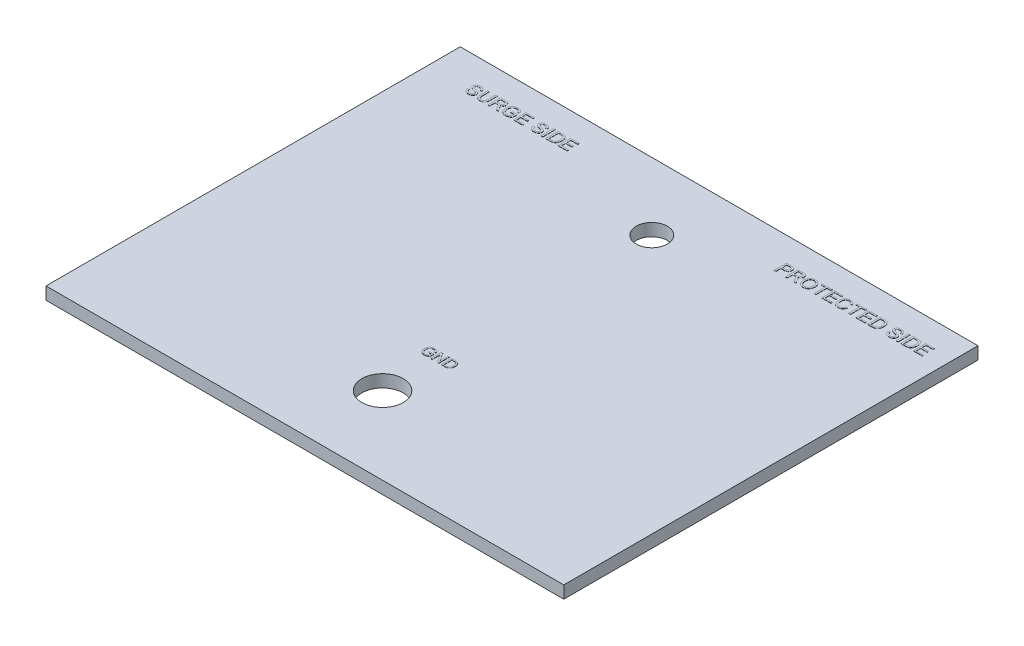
from build123d import *

# Parameters (mm, degrees)
SKETCH1_W           = 63.5
SKETCH1_H           = 50.8
BOSS_EXTRUDE1_DEPTH = 1.524
SKETCH2_R           = 2.54
SKETCH2_R_2         = 1.905
CUT_EXTRUDE1_DEPTH  = 45.927136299
SKETCH3_W           = 0.213772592
SKETCH3_H           = 1.515842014
SKETCH3_W_2         = 0.213772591
BOSS_EXTRUDE2_DEPTH = 0.0254


with BuildPart() as part:
    # Sketch1 → Boss-Extrude1 (new body)
    with BuildSketch(Plane(origin=(0, 0, 0), x_dir=(1, 0, 0), z_dir=(0, 1, 0))):
        with Locations((0, 6.35)):
            Rectangle(SKETCH1_W, SKETCH1_H)
    extrude(amount=BOSS_EXTRUDE1_DEPTH)

    # Sketch2 → Cut-Extrude1 (cut, through all)
    with BuildSketch(Plane(origin=(0, 1.524, 0), x_dir=(1, 0, 0), z_dir=(0, 1, 0))):
        with Locations(Location((0, -9.525, 0), (0, 0, 270))):
            Circle(SKETCH2_R)
        with Locations(Location((0, 23.495, 0), (0, 0, 270))):
            Circle(SKETCH2_R_2)
    extrude(amount=-CUT_EXTRUDE1_DEPTH, mode=Mode.SUBTRACT)

    # Sketch3 → Boss-Extrude2 (add)
    # profile 1 of 25: a face of its own
    with BuildSketch(Plane(origin=(0, 1.524, 0), x_dir=(1, 0, 0), z_dir=(0, 1, 0))):
        with BuildLine():
            Line((-26.848705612, 27.756479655), (-26.63493302, 27.756479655))
            add(Edge.make_bspline(
                [(-26.63493302, 27.756479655), (-26.632581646, 27.737285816), (-26.628064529, 27.700413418), (-26.615434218, 27.648152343), (-26.599178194, 27.601164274), (-26.578923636, 27.558825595), (-26.552279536, 27.521643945), (-26.520177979, 27.488106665), (-26.481192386, 27.45906541), (-26.437186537, 27.433220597), (-26.388176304, 27.412928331), (-26.335853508, 27.39788534), (-26.280467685, 27.388972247), (-26.242542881, 27.387822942), (-26.223177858, 27.387236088)],
                knots=[0, 0, 0, 0, 1.125557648, 2.162256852, 3.1243583, 4.018160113, 4.88511607, 5.777380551, 6.711250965, 7.707237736, 8.743031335, 9.791730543, 10.872421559, 12, 12, 12, 12], degree=3))
            add(Edge.make_bspline(
                [(-26.223177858, 27.387236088), (-26.206041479, 27.387553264), (-26.17262886, 27.388171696), (-26.124293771, 27.395600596), (-26.078810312, 27.406138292), (-26.037024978, 27.422078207), (-25.999091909, 27.441434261), (-25.966151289, 27.464845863), (-25.93802834, 27.491247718), (-25.916006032, 27.521335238), (-25.898705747, 27.552861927), (-25.886014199, 27.585268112), (-25.878454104, 27.618373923), (-25.877490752, 27.64064922), (-25.877012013, 27.651718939)],
                knots=[0, 0, 0, 0, 1.267006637, 2.470417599, 3.611360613, 4.716023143, 5.771382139, 6.754486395, 7.697536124, 8.612899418, 9.501261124, 10.352596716, 11.181322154, 12, 12, 12, 12], degree=3))
            add(Edge.make_bspline(
                [(-25.877012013, 27.651718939), (-25.877523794, 27.662676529), (-25.878524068, 27.684093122), (-25.885042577, 27.715273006), (-25.897431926, 27.743811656), (-25.913508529, 27.770873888), (-25.935873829, 27.795616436), (-25.964129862, 27.818414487), (-25.998899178, 27.83908342), (-26.024849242, 27.850402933), (-26.038556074, 27.856381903)],
                knots=[0, 0, 0, 0, 0.942140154, 1.841411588, 2.718743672, 3.605002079, 4.535543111, 5.568170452, 6.715506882, 8, 8, 8, 8], degree=3))
            add(Edge.make_bspline(
                [(-26.038556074, 27.856381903), (-26.043896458, 27.858573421), (-26.055961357, 27.863524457), (-26.076640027, 27.870078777), (-26.101177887, 27.87855418), (-26.130164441, 27.887282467), (-26.163444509, 27.896515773), (-26.200962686, 27.906966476), (-26.242698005, 27.918080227), (-26.287466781, 27.929909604), (-26.332669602, 27.941938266), (-26.375855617, 27.953978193), (-26.415588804, 27.966200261), (-26.452194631, 27.977968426), (-26.485484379, 27.989785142), (-26.515552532, 28.001326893), (-26.542436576, 28.012359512), (-26.558856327, 28.020471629), (-26.566610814, 28.024302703)],
                knots=[0, 0, 0, 0, 0.499201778, 1.127787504, 1.87543728, 2.745208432, 3.745951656, 4.863402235, 6.114490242, 7.482339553, 8.869366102, 10.161191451, 11.360587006, 12.46547846, 13.487450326, 14.41601931, 15.251940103, 16, 16, 16, 16], degree=3))
            add(Edge.make_bspline(
                [(-26.566610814, 28.024302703), (-26.584451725, 28.033940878), (-26.618889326, 28.052545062), (-26.665238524, 28.085809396), (-26.704292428, 28.122722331), (-26.735886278, 28.163230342), (-26.760645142, 28.206648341), (-26.777349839, 28.253050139), (-26.788791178, 28.301593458), (-26.789860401, 28.3349746), (-26.790403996, 28.351945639)],
                knots=[0, 0, 0, 0, 1.158441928, 2.236094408, 3.251151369, 4.220012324, 5.163146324, 6.095083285, 7.031536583, 8, 8, 8, 8], degree=3))
            add(Edge.make_bspline(
                [(-26.790403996, 28.351945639), (-26.789682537, 28.370738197), (-26.788247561, 28.40811646), (-26.775518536, 28.46296673), (-26.755215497, 28.51574728), (-26.732104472, 28.557650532), (-26.709566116, 28.589337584), (-26.690881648, 28.61215802), (-26.669923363, 28.633252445), (-26.647336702, 28.652915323), (-26.622717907, 28.670852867), (-26.596677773, 28.68780229), (-26.568273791, 28.702370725), (-26.528361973, 28.720913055), (-26.474969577, 28.739429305), (-26.407755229, 28.755563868), (-26.337014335, 28.765065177), (-26.288795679, 28.766373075), (-26.264171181, 28.767040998)],
                knots=[0, 0, 0, 0, 1.199927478, 2.386647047, 3.578628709, 4.806592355, 5.433127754, 6.062729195, 6.689531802, 7.331674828, 7.974827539, 8.635320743, 9.315455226, 10.01318112, 11.447700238, 12.918145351, 14.426146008, 16, 16, 16, 16], degree=3))
            add(Edge.make_bspline(
                [(-26.264171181, 28.767040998), (-26.237218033, 28.766423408), (-26.184735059, 28.765220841), (-26.108475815, 28.755215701), (-26.037346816, 28.738034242), (-25.981565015, 28.718801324), (-25.940326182, 28.699330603), (-25.911028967, 28.684137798), (-25.883835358, 28.666572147), (-25.858500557, 28.647563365), (-25.83478924, 28.627120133), (-25.813310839, 28.604756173), (-25.793132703, 28.581234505), (-25.769420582, 28.547464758), (-25.743853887, 28.50277069), (-25.721748, 28.44486775), (-25.706560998, 28.38375595), (-25.703606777, 28.341507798), (-25.702107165, 28.320061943)],
                knots=[0, 0, 0, 0, 1.607600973, 3.130308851, 4.577334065, 5.967726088, 6.640410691, 7.296826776, 7.935019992, 8.569057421, 9.185393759, 9.8003086, 10.417295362, 11.032210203, 12.259799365, 13.477607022, 14.719591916, 16, 16, 16, 16], degree=3))
            Line((-25.702107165, 28.320061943), (-25.915879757, 28.320061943))
            add(Edge.make_bspline(
                [(-25.915879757, 28.320061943), (-25.917238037, 28.330916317), (-25.919895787, 28.352155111), (-25.926489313, 28.38290146), (-25.93573211, 28.411457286), (-25.946558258, 28.438088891), (-25.959681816, 28.462519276), (-25.974980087, 28.484983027), (-25.992639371, 28.505215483), (-26.012205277, 28.523751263), (-26.034273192, 28.539890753), (-26.058729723, 28.553900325), (-26.085616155, 28.565735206), (-26.1149088, 28.57542836), (-26.146613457, 28.582944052), (-26.18080224, 28.588472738), (-26.217461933, 28.591304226), (-26.242708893, 28.591853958), (-26.255668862, 28.59213615)],
                knots=[0, 0, 0, 0, 1.074487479, 2.102453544, 3.083708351, 4.020042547, 4.923259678, 5.803182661, 6.684453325, 7.556870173, 8.445961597, 9.363679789, 10.320905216, 11.327237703, 12.390948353, 13.519046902, 14.726457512, 16, 16, 16, 16], degree=3))
            add(Edge.make_bspline(
                [(-26.255668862, 28.59213615), (-26.269140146, 28.59203461), (-26.295217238, 28.591838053), (-26.332914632, 28.588255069), (-26.367855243, 28.583339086), (-26.399979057, 28.576087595), (-26.429180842, 28.566595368), (-26.455893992, 28.555634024), (-26.479370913, 28.541743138), (-26.500158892, 28.526270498), (-26.518091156, 28.509150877), (-26.533546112, 28.491110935), (-26.547214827, 28.472680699), (-26.557835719, 28.452852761), (-26.566482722, 28.432378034), (-26.57206099, 28.41087166), (-26.576010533, 28.388731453), (-26.576421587, 28.373624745), (-26.576631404, 28.365913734)],
                knots=[0, 0, 0, 0, 1.464176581, 2.834285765, 4.113735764, 5.29917439, 6.409476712, 7.449999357, 8.431575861, 9.367089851, 10.262376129, 11.120706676, 11.948504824, 12.751342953, 13.560717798, 14.359016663, 15.162382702, 16, 16, 16, 16], degree=3))
            add(Edge.make_bspline(
                [(-26.576631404, 28.365913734), (-26.576078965, 28.352872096), (-26.575006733, 28.327559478), (-26.564057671, 28.291597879), (-26.547217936, 28.258816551), (-26.530628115, 28.240980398), (-26.522277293, 28.23200221)],
                knots=[0, 0, 0, 0, 1.050964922, 2.039826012, 3.013306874, 4, 4, 4, 4], degree=3))
            add(Edge.make_bspline(
                [(-26.522277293, 28.23200221), (-26.517013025, 28.227515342), (-26.505371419, 28.217592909), (-26.483710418, 28.204461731), (-26.456853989, 28.191194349), (-26.424622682, 28.178005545), (-26.387071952, 28.164735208), (-26.344262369, 28.151071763), (-26.296030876, 28.137501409), (-26.243847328, 28.124424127), (-26.191129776, 28.111294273), (-26.141030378, 28.098214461), (-26.09503065, 28.085818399), (-26.053203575, 28.073728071), (-26.015505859, 28.061977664), (-25.982068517, 28.050320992), (-25.952621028, 28.03959981), (-25.934580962, 28.032056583), (-25.926204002, 28.028553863)],
                knots=[0, 0, 0, 0, 0.523891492, 1.158553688, 1.913783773, 2.794766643, 3.797521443, 4.933638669, 6.202080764, 7.596537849, 9.013317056, 10.322179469, 11.523240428, 12.626146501, 13.623953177, 14.517289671, 15.311498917, 16, 16, 16, 16], degree=3))
            add(Edge.make_bspline(
                [(-25.926204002, 28.028553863), (-25.915305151, 28.023528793), (-25.893912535, 28.013665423), (-25.863607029, 27.996825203), (-25.835328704, 27.97933754), (-25.809306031, 27.960731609), (-25.785623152, 27.940968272), (-25.764015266, 27.920273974), (-25.744351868, 27.898765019), (-25.727426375, 27.875752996), (-25.712229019, 27.852168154), (-25.69893032, 27.827680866), (-25.688222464, 27.802147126), (-25.678831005, 27.77587472), (-25.672075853, 27.748571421), (-25.666778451, 27.720513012), (-25.663688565, 27.69156761), (-25.66339043, 27.671969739), (-25.663239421, 27.662043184)],
                knots=[0, 0, 0, 0, 1.198900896, 2.353241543, 3.461831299, 4.520043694, 5.547003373, 6.541368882, 7.508191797, 8.454912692, 9.392021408, 10.310662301, 11.235020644, 12.156274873, 13.095836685, 14.042125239, 15.00831306, 16, 16, 16, 16], degree=3))
            add(Edge.make_bspline(
                [(-25.663239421, 27.662043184), (-25.664030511, 27.642232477), (-25.665601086, 27.602901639), (-25.679124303, 27.544926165), (-25.700368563, 27.488748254), (-25.72528272, 27.444167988), (-25.748834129, 27.410115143), (-25.768618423, 27.385639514), (-25.790558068, 27.363008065), (-25.814112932, 27.341511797), (-25.839465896, 27.321589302), (-25.866830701, 27.303233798), (-25.895918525, 27.286254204), (-25.937455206, 27.265563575), (-25.992622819, 27.243919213), (-26.062895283, 27.225894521), (-26.136953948, 27.214201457), (-26.1878072, 27.212963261), (-26.213764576, 27.21233124)],
                knots=[0, 0, 0, 0, 1.197055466, 2.376552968, 3.581957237, 4.820753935, 5.454298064, 6.085440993, 6.72202542, 7.359198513, 8.013298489, 8.67051481, 9.351020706, 10.049282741, 11.476266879, 12.925760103, 14.430794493, 16, 16, 16, 16], degree=3))
            add(Edge.make_bspline(
                [(-26.213764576, 27.21233124), (-26.230268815, 27.212467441), (-26.26259826, 27.212734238), (-26.31010277, 27.215965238), (-26.35562721, 27.220639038), (-26.399126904, 27.227600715), (-26.440465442, 27.236734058), (-26.47979121, 27.247701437), (-26.517197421, 27.260332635), (-26.552553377, 27.275186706), (-26.585766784, 27.292445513), (-26.617434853, 27.311063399), (-26.647039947, 27.332167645), (-26.67464439, 27.355426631), (-26.700947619, 27.380168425), (-26.724859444, 27.407403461), (-26.747192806, 27.436335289), (-26.767437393, 27.467228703), (-26.78552285, 27.499679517), (-26.801786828, 27.533142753), (-26.815489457, 27.567861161), (-26.826532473, 27.603659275), (-26.835886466, 27.640297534), (-26.842373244, 27.678081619), (-26.847142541, 27.716892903), (-26.848181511, 27.743206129), (-26.848705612, 27.756479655)],
                knots=[0, 0, 0, 0, 1.259822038, 2.467811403, 3.633536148, 4.752793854, 5.829021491, 6.863980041, 7.868367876, 8.841470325, 9.788447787, 10.724101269, 11.643985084, 12.560193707, 13.478453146, 14.398077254, 15.323914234, 16.266973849, 17.21495974, 18.158525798, 19.105629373, 20.061269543, 21.017128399, 21.990322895, 22.986232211, 24, 24, 24, 24], degree=3))
        make_face()
    # profile 2 of 25: a face of its own
    with BuildSketch(Plane(origin=(0, 1.524, 0), x_dir=(1, 0, 0), z_dir=(0, 1, 0))):
        with BuildLine():
            Line((-24.419471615, 28.747607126), (-24.205699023, 28.747607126))
            Line((-24.205699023, 28.747607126), (-24.205699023, 27.875512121))
            add(Edge.make_bspline(
                [(-24.205699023, 27.875512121), (-24.205920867, 27.85698765), (-24.206352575, 27.820938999), (-24.208338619, 27.768366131), (-24.212207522, 27.718714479), (-24.218130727, 27.672064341), (-24.22482693, 27.628213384), (-24.233745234, 27.587401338), (-24.243973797, 27.549463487), (-24.255742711, 27.514143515), (-24.269987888, 27.48120281), (-24.286263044, 27.449935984), (-24.305242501, 27.42025175), (-24.326877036, 27.392195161), (-24.351281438, 27.365919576), (-24.377789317, 27.340751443), (-24.407100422, 27.317382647), (-24.438892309, 27.295545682), (-24.473204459, 27.275726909), (-24.510187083, 27.258628), (-24.549795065, 27.244530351), (-24.591849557, 27.232536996), (-24.636560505, 27.223645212), (-24.683784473, 27.216900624), (-24.733583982, 27.212933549), (-24.76765472, 27.212534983), (-24.785071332, 27.21233124)],
                knots=[0, 0, 0, 0, 1.311435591, 2.552055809, 3.723716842, 4.835547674, 5.880436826, 6.862821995, 7.791032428, 8.661143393, 9.495683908, 10.328993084, 11.1538804, 11.986573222, 12.833449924, 13.690091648, 14.571895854, 15.484149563, 16.418232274, 17.373591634, 18.364096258, 19.391643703, 20.466661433, 21.588422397, 22.767226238, 24, 24, 24, 24], degree=3))
            add(Edge.make_bspline(
                [(-24.785071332, 27.21233124), (-24.802080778, 27.212581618), (-24.835222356, 27.213069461), (-24.883788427, 27.216368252), (-24.92998543, 27.22221407), (-24.973952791, 27.229885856), (-25.015542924, 27.240283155), (-25.054694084, 27.253009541), (-25.091539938, 27.267896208), (-25.126084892, 27.28483371), (-25.157925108, 27.304388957), (-25.187623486, 27.325734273), (-25.215047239, 27.349102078), (-25.23994161, 27.374702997), (-25.262601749, 27.402151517), (-25.282711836, 27.431740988), (-25.300320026, 27.463524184), (-25.315869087, 27.497417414), (-25.329416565, 27.533919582), (-25.340340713, 27.573528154), (-25.350223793, 27.616141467), (-25.357809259, 27.661914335), (-25.364472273, 27.710789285), (-25.368336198, 27.762910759), (-25.371280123, 27.818189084), (-25.371578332, 27.856073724), (-25.371731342, 27.875512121)],
                knots=[0, 0, 0, 0, 1.192889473, 2.324252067, 3.41162405, 4.457325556, 5.452435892, 6.415456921, 7.342133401, 8.237363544, 9.110250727, 9.959377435, 10.800155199, 11.633438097, 12.46053001, 13.293359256, 14.138649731, 15.005774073, 15.906391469, 16.865847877, 17.8852706, 18.972920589, 20.118424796, 21.343408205, 22.636917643, 24, 24, 24, 24], degree=3))
            Line((-25.371731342, 27.875512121), (-25.371731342, 28.747607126))
            Line((-25.371731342, 28.747607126), (-25.15795875, 28.747607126))
            Line((-25.15795875, 28.747607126), (-25.15795875, 27.885532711))
            add(Edge.make_bspline(
                [(-25.15795875, 27.885532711), (-25.157819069, 27.869843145), (-25.157549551, 27.839569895), (-25.15614338, 27.795715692), (-25.153331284, 27.755019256), (-25.149854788, 27.717418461), (-25.14507525, 27.683049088), (-25.138954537, 27.651961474), (-25.132089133, 27.62404975), (-25.12180828, 27.591408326), (-25.104743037, 27.554971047), (-25.077849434, 27.51635051), (-25.04503389, 27.482798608), (-25.005982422, 27.455090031), (-24.961635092, 27.433073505), (-24.912290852, 27.417892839), (-24.858535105, 27.408130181), (-24.821150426, 27.407168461), (-24.801772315, 27.40666996)],
                knots=[0, 0, 0, 0, 1.090245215, 2.103644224, 3.048223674, 3.924421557, 4.727106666, 5.45815927, 6.12513286, 6.723455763, 7.834131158, 8.905266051, 9.9795367, 11.078391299, 12.21701853, 13.404826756, 14.65480846, 16, 16, 16, 16], degree=3))
            add(Edge.make_bspline(
                [(-24.801772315, 27.40666996), (-24.785163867, 27.406952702), (-24.753094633, 27.407498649), (-24.70685171, 27.411901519), (-24.66445801, 27.419928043), (-24.625561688, 27.430271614), (-24.590436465, 27.444318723), (-24.558867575, 27.461337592), (-24.530965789, 27.481419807), (-24.50653089, 27.505109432), (-24.485477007, 27.53345852), (-24.467732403, 27.567243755), (-24.452616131, 27.606494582), (-24.440228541, 27.651340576), (-24.431196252, 27.701994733), (-24.424135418, 27.758130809), (-24.420433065, 27.819995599), (-24.419801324, 27.863058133), (-24.419471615, 27.885532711)],
                knots=[0, 0, 0, 0, 1.111629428, 2.146443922, 3.104513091, 3.997025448, 4.836178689, 5.630482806, 6.392099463, 7.129930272, 7.899580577, 8.745272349, 9.676297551, 10.710246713, 11.854352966, 13.117392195, 14.495550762, 16, 16, 16, 16], degree=3))
            Line((-24.419471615, 27.885532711), (-24.419471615, 28.747607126))
        make_face()
    # profile 3 of 25: a face of its own
    with BuildSketch(Plane(origin=(0, 1.524, 0), x_dir=(1, 0, 0), z_dir=(0, 1, 0))):
        with BuildLine():
            Line((-23.855889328, 27.231765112), (-23.855889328, 28.747607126))
            Line((-23.855889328, 28.747607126), (-23.198174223, 28.747607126))
            add(Edge.make_bspline(
                [(-23.198174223, 28.747607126), (-23.182687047, 28.747485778), (-23.152713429, 28.747250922), (-23.109245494, 28.74558841), (-23.068672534, 28.742004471), (-23.030919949, 28.738128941), (-22.995994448, 28.732180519), (-22.963932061, 28.725357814), (-22.934683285, 28.717238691), (-22.908117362, 28.707649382), (-22.883469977, 28.696800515), (-22.860623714, 28.683414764), (-22.838628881, 28.668746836), (-22.818301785, 28.651514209), (-22.799106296, 28.632646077), (-22.781060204, 28.611886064), (-22.764430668, 28.589054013), (-22.743920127, 28.556376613), (-22.721916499, 28.512857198), (-22.70358402, 28.457161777), (-22.691763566, 28.398902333), (-22.690498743, 28.359088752), (-22.68985701, 28.338888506)],
                knots=[0, 0, 0, 0, 1.242255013, 2.404239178, 3.487702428, 4.508875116, 5.447164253, 6.327763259, 7.137389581, 7.87956647, 8.591787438, 9.293660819, 10.000726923, 10.709654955, 11.427269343, 12.158170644, 12.913245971, 13.690346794, 15.251572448, 16.809945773, 18.381459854, 20, 20, 20, 20], degree=3))
            add(Edge.make_bspline(
                [(-22.68985701, 28.338888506), (-22.690153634, 28.32592175), (-22.690739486, 28.300311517), (-22.695227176, 28.26265762), (-22.703347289, 28.226680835), (-22.713759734, 28.192066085), (-22.728011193, 28.159303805), (-22.744520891, 28.127724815), (-22.764974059, 28.098196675), (-22.787873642, 28.069933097), (-22.814133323, 28.043539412), (-22.843984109, 28.01996784), (-22.877130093, 27.998765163), (-22.913727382, 27.980516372), (-22.953354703, 27.963836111), (-22.996509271, 27.950404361), (-23.043016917, 27.939436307), (-23.075258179, 27.934125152), (-23.091895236, 27.931384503)],
                knots=[0, 0, 0, 0, 0.982609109, 1.940720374, 2.867584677, 3.775009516, 4.675469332, 5.571146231, 6.471115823, 7.392408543, 8.32534739, 9.286126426, 10.269214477, 11.301811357, 12.381622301, 13.524260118, 14.722474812, 16, 16, 16, 16], degree=3))
            add(Edge.make_bspline(
                [(-23.091895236, 27.931384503), (-23.079691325, 27.925219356), (-23.056515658, 27.913511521), (-23.02442866, 27.895153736), (-22.997229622, 27.876396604), (-22.981471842, 27.862980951), (-22.974077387, 27.856685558)],
                knots=[0, 0, 0, 0, 1.172304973, 2.226249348, 3.167654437, 4, 4, 4, 4], degree=3))
            add(Edge.make_bspline(
                [(-22.974077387, 27.856685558), (-22.959757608, 27.842647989), (-22.930343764, 27.813813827), (-22.88981021, 27.764700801), (-22.850511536, 27.710030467), (-22.826634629, 27.670520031), (-22.814355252, 27.650200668)],
                knots=[0, 0, 0, 0, 0.918110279, 1.885863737, 2.912745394, 4, 4, 4, 4], degree=3))
            Line((-22.814355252, 27.650200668), (-22.565662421, 27.231765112))
            Line((-22.565662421, 27.231765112), (-22.810711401, 27.231765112))
            Line((-22.810711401, 27.231765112), (-22.999584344, 27.551816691))
            add(Edge.make_bspline(
                [(-22.999584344, 27.551816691), (-23.006375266, 27.563046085), (-23.019534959, 27.584806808), (-23.038543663, 27.616587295), (-23.057181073, 27.645846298), (-23.074466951, 27.673420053), (-23.091102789, 27.698807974), (-23.106927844, 27.722098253), (-23.121506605, 27.743596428), (-23.139564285, 27.768625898), (-23.160580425, 27.796321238), (-23.185104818, 27.82484221), (-23.208459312, 27.8475816), (-23.237220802, 27.869879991), (-23.272846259, 27.890736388), (-23.30312857, 27.900319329), (-23.317813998, 27.904966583)],
                knots=[0, 0, 0, 0, 1.130940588, 2.191577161, 3.191089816, 4.120344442, 4.99615009, 5.80661983, 6.546979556, 7.234477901, 8.466216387, 9.541989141, 10.473533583, 11.269175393, 12.675684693, 14, 14, 14, 14], degree=3))
            add(Edge.make_bspline(
                [(-23.317813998, 27.904966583), (-23.323975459, 27.906077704), (-23.33804226, 27.908614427), (-23.361927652, 27.910271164), (-23.390867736, 27.912029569), (-23.411841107, 27.911978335), (-23.423182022, 27.911950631)],
                knots=[0, 0, 0, 0, 0.709978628, 1.620902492, 2.713552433, 4, 4, 4, 4], degree=3))
            Line((-23.423182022, 27.911950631), (-23.642116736, 27.911950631))
            Line((-23.642116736, 27.911950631), (-23.642116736, 27.231765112))
            Line((-23.642116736, 27.231765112), (-23.855889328, 27.231765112))
        make_face()
        with BuildLine():
            Line((-23.642116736, 28.086855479), (-23.236131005, 28.086855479))
            add(Edge.make_bspline(
                [(-23.236131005, 28.086855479), (-23.215773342, 28.087173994), (-23.177716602, 28.087769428), (-23.124500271, 28.092853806), (-23.079148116, 28.1009331), (-23.04076359, 28.112717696), (-23.00851453, 28.129078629), (-22.980466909, 28.149017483), (-22.957158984, 28.173992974), (-22.937769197, 28.202172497), (-22.922697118, 28.233182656), (-22.91182484, 28.265754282), (-22.904708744, 28.29961363), (-22.903992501, 28.322657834), (-22.903629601, 28.334333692)],
                knots=[0, 0, 0, 0, 1.546323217, 2.890706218, 4.056530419, 5.041445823, 5.928701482, 6.793137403, 7.641659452, 8.509781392, 9.383301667, 10.251423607, 11.114044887, 12, 12, 12, 12], degree=3))
            add(Edge.make_bspline(
                [(-22.903629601, 28.334333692), (-22.903911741, 28.342842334), (-22.90446437, 28.359508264), (-22.907361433, 28.383969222), (-22.912994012, 28.407212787), (-22.920431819, 28.429361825), (-22.930370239, 28.450254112), (-22.942176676, 28.470051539), (-22.956265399, 28.488644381), (-22.972403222, 28.506089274), (-22.990932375, 28.521962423), (-23.012097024, 28.535657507), (-23.035730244, 28.547295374), (-23.061859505, 28.556531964), (-23.090402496, 28.563919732), (-23.121521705, 28.568834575), (-23.155074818, 28.57239094), (-23.178325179, 28.57259656), (-23.190279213, 28.572702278)],
                knots=[0, 0, 0, 0, 0.965208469, 1.890559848, 2.786986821, 3.67262109, 4.535197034, 5.405224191, 6.282113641, 7.175449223, 8.095446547, 9.040936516, 10.026471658, 11.075712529, 12.17809725, 13.364958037, 14.645208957, 16, 16, 16, 16], degree=3))
            Line((-23.190279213, 28.572702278), (-23.642116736, 28.572702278))
            Line((-23.642116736, 28.572702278), (-23.642116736, 28.086855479))
        make_face(mode=Mode.SUBTRACT)
    # profile 4 of 25: a face of its own
    with BuildSketch(Plane(origin=(0, 1.524, 0), x_dir=(1, 0, 0), z_dir=(0, 1, 0))):
        with BuildLine():
            Line((-21.640427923, 27.834215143), (-21.640427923, 28.009119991))
            Line((-21.640427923, 28.009119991), (-21.01854402, 28.009119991))
            Line((-21.01854402, 28.009119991), (-21.01854402, 27.448270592))
            add(Edge.make_bspline(
                [(-21.01854402, 27.448270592), (-21.04308049, 27.429582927), (-21.091371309, 27.392803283), (-21.167105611, 27.344837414), (-21.244082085, 27.304156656), (-21.322087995, 27.270571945), (-21.401391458, 27.244651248), (-21.481650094, 27.226097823), (-21.562951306, 27.214346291), (-21.61761479, 27.213003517), (-21.644982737, 27.21233124)],
                knots=[0, 0, 0, 0, 1.08433114, 2.134098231, 3.14842993, 4.143565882, 5.117308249, 6.078377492, 7.037916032, 8, 8, 8, 8], degree=3))
            add(Edge.make_bspline(
                [(-21.644982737, 27.21233124), (-21.663313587, 27.212612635), (-21.699728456, 27.213171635), (-21.753642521, 27.217953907), (-21.806297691, 27.225059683), (-21.857594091, 27.235508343), (-21.907712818, 27.248810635), (-21.956557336, 27.265249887), (-22.00414812, 27.284433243), (-22.050219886, 27.306426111), (-22.094080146, 27.331624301), (-22.135608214, 27.359252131), (-22.1742802, 27.389725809), (-22.21015563, 27.422796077), (-22.243104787, 27.458659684), (-22.273615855, 27.496839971), (-22.300870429, 27.538036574), (-22.325470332, 27.581491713), (-22.347192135, 27.626876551), (-22.366158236, 27.673803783), (-22.381835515, 27.722160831), (-22.394910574, 27.77173377), (-22.405308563, 27.822503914), (-22.412571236, 27.874630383), (-22.416846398, 27.928073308), (-22.417468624, 27.9641715), (-22.417782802, 27.982398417)],
                knots=[0, 0, 0, 0, 1.072770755, 2.131096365, 3.165876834, 4.181397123, 5.193125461, 6.199217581, 7.195986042, 8.195005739, 9.184865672, 10.154356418, 11.112044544, 12.063776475, 13.007136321, 13.960176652, 14.921449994, 15.895149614, 16.88092309, 17.86448639, 18.855604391, 19.854360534, 20.864074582, 21.88711945, 22.933151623, 24, 24, 24, 24], degree=3))
            add(Edge.make_bspline(
                [(-22.417782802, 27.982398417), (-22.41746776, 28.000524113), (-22.416842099, 28.036521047), (-22.412530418, 28.090161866), (-22.405241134, 28.142863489), (-22.395177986, 28.194656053), (-22.382478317, 28.245494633), (-22.366657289, 28.295389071), (-22.347728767, 28.344293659), (-22.326290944, 28.392105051), (-22.302414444, 28.438139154), (-22.274994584, 28.480924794), (-22.246166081, 28.521461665), (-22.213550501, 28.557987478), (-22.179417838, 28.592388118), (-22.142098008, 28.623005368), (-22.102531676, 28.650760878), (-22.060547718, 28.675356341), (-22.016393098, 28.69682096), (-21.970594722, 28.715724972), (-21.923048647, 28.731411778), (-21.874027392, 28.744646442), (-21.823259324, 28.754480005), (-21.770875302, 28.761877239), (-21.716816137, 28.766102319), (-21.680213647, 28.766725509), (-21.66168372, 28.767040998)],
                knots=[0, 0, 0, 0, 1.059979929, 2.105079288, 3.144800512, 4.169876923, 5.189194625, 6.207600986, 7.228841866, 8.254191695, 9.270945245, 10.257936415, 11.22408152, 12.176290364, 13.118065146, 14.055588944, 14.994904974, 15.942096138, 16.897776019, 17.864011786, 18.837383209, 19.823806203, 20.831455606, 21.859450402, 22.916351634, 24, 24, 24, 24], degree=3))
            add(Edge.make_bspline(
                [(-21.66168372, 28.767040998), (-21.634934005, 28.766397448), (-21.58266859, 28.765140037), (-21.506148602, 28.755360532), (-21.433778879, 28.738626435), (-21.376426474, 28.719400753), (-21.333350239, 28.700665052), (-21.302901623, 28.685522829), (-21.274280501, 28.668987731), (-21.24715742, 28.651597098), (-21.222138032, 28.632209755), (-21.198893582, 28.611737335), (-21.1773629, 28.589934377), (-21.150855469, 28.558817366), (-21.120532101, 28.515592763), (-21.090106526, 28.456896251), (-21.063457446, 28.391465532), (-21.050267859, 28.344608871), (-21.043443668, 28.320365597)],
                knots=[0, 0, 0, 0, 1.539867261, 3.008697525, 4.432261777, 5.810773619, 6.484177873, 7.135742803, 7.767512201, 8.386601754, 8.989234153, 9.587908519, 10.168964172, 10.7517707, 11.940093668, 13.199243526, 14.550910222, 16, 16, 16, 16], degree=3))
            Line((-21.043443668, 28.320365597), (-21.238997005, 28.271173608))
            add(Edge.make_bspline(
                [(-21.238997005, 28.271173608), (-21.244641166, 28.289162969), (-21.255450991, 28.323616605), (-21.274491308, 28.371770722), (-21.296671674, 28.413351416), (-21.32038795, 28.449951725), (-21.348642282, 28.481436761), (-21.381446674, 28.509334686), (-21.41978337, 28.533563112), (-21.462808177, 28.554307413), (-21.509583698, 28.57124689), (-21.559368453, 28.583318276), (-21.61165555, 28.590825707), (-21.647386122, 28.591693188), (-21.665631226, 28.59213615)],
                knots=[0, 0, 0, 0, 1.164883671, 2.23101188, 3.193404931, 4.072828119, 4.918883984, 5.797350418, 6.725503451, 7.712871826, 8.743577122, 9.793233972, 10.87315899, 12, 12, 12, 12], degree=3))
            add(Edge.make_bspline(
                [(-21.665631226, 28.59213615), (-21.687212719, 28.591592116), (-21.728997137, 28.590538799), (-21.789548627, 28.582987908), (-21.845582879, 28.570106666), (-21.896912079, 28.551751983), (-21.943320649, 28.529190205), (-21.985472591, 28.503677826), (-22.022653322, 28.474470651), (-22.055004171, 28.441941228), (-22.083138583, 28.407142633), (-22.108226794, 28.370870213), (-22.13004425, 28.332831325), (-22.141697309, 28.306109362), (-22.14753052, 28.29273306)],
                knots=[0, 0, 0, 0, 1.282088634, 2.482280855, 3.618640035, 4.691464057, 5.71354971, 6.679981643, 7.61357903, 8.515091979, 9.399860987, 10.268958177, 11.133486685, 12, 12, 12, 12], degree=3))
            add(Edge.make_bspline(
                [(-22.14753052, 28.29273306), (-22.156241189, 28.269206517), (-22.17377425, 28.221851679), (-22.190902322, 28.147219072), (-22.201958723, 28.069779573), (-22.203319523, 28.017054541), (-22.20401021, 27.990293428)],
                knots=[0, 0, 0, 0, 0.971932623, 1.956331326, 2.96271565, 4, 4, 4, 4], degree=3))
            add(Edge.make_bspline(
                [(-22.20401021, 27.990293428), (-22.203905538, 27.973888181), (-22.203700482, 27.941749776), (-22.200025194, 27.894561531), (-22.195219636, 27.849294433), (-22.18742047, 27.806170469), (-22.178147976, 27.765061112), (-22.166646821, 27.725943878), (-22.152588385, 27.689014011), (-22.136885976, 27.653909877), (-22.118919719, 27.621010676), (-22.098912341, 27.590351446), (-22.076938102, 27.561948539), (-22.053071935, 27.535770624), (-22.027667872, 27.511291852), (-21.999930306, 27.489446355), (-21.970171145, 27.46991685), (-21.92842025, 27.446659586), (-21.873370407, 27.423181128), (-21.805132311, 27.402233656), (-21.7346074, 27.389792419), (-21.686935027, 27.388092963), (-21.662898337, 27.387236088)],
                knots=[0, 0, 0, 0, 1.070760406, 2.097653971, 3.088708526, 4.041547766, 4.95691435, 5.839291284, 6.700934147, 7.534993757, 8.348268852, 9.145600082, 9.922850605, 10.690119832, 11.456705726, 12.223547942, 12.991528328, 13.778467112, 15.341275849, 16.888285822, 18.431055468, 20, 20, 20, 20], degree=3))
            add(Edge.make_bspline(
                [(-21.662898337, 27.387236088), (-21.641812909, 27.387930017), (-21.599739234, 27.389314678), (-21.537100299, 27.398923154), (-21.47544612, 27.415238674), (-21.415836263, 27.437266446), (-21.360075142, 27.462497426), (-21.310716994, 27.489532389), (-21.267856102, 27.516508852), (-21.243746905, 27.537165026), (-21.232316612, 27.546958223)],
                knots=[0, 0, 0, 0, 1.08078364, 2.156585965, 3.240205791, 4.344938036, 5.41078367, 6.374425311, 7.229306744, 8, 8, 8, 8], degree=3))
            Line((-21.232316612, 27.546958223), (-21.232316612, 27.834215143))
            Line((-21.232316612, 27.834215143), (-21.640427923, 27.834215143))
        make_face()
    # profile 5 of 25: a face of its own
    with BuildSketch(Plane(origin=(0, 1.524, 0), x_dir=(1, 0, 0), z_dir=(0, 1, 0))):
        Polygon((-20.707602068, 27.231765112), (-20.707602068, 28.747607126), (-19.63873911, 28.747607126), (-19.63873911, 28.572702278), (-20.493829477, 28.572702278), (-20.493829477, 28.106289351), (-19.697040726, 28.106289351), (-19.697040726, 27.931384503), (-20.493829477, 27.931384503), (-20.493829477, 27.40666996), (-19.599871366, 27.40666996), (-19.599871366, 27.231765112), align=None)
    # profile 6 of 25: a face of its own
    with BuildSketch(Plane(origin=(0, 1.524, 0), x_dir=(1, 0, 0), z_dir=(0, 1, 0))):
        with BuildLine():
            Line((-18.803082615, 27.756479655), (-18.589310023, 27.756479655))
            add(Edge.make_bspline(
                [(-18.589310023, 27.756479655), (-18.586958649, 27.737285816), (-18.582441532, 27.700413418), (-18.569811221, 27.648152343), (-18.553555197, 27.601164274), (-18.533300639, 27.558825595), (-18.506656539, 27.521643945), (-18.474554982, 27.488106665), (-18.435569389, 27.45906541), (-18.391563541, 27.433220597), (-18.342553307, 27.412928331), (-18.290230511, 27.39788534), (-18.234844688, 27.388972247), (-18.196919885, 27.387822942), (-18.177554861, 27.387236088)],
                knots=[0, 0, 0, 0, 1.125557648, 2.162256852, 3.1243583, 4.018160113, 4.88511607, 5.777380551, 6.711250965, 7.707237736, 8.743031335, 9.791730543, 10.872421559, 12, 12, 12, 12], degree=3))
            add(Edge.make_bspline(
                [(-18.177554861, 27.387236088), (-18.160418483, 27.387553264), (-18.127005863, 27.388171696), (-18.078670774, 27.395600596), (-18.033187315, 27.406138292), (-17.991401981, 27.422078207), (-17.953468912, 27.441434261), (-17.920528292, 27.464845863), (-17.892405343, 27.491247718), (-17.870383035, 27.521335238), (-17.85308275, 27.552861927), (-17.840391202, 27.585268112), (-17.832831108, 27.618373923), (-17.831867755, 27.64064922), (-17.831389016, 27.651718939)],
                knots=[0, 0, 0, 0, 1.267006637, 2.470417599, 3.611360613, 4.716023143, 5.771382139, 6.754486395, 7.697536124, 8.612899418, 9.501261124, 10.352596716, 11.181322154, 12, 12, 12, 12], degree=3))
            add(Edge.make_bspline(
                [(-17.831389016, 27.651718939), (-17.831900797, 27.662676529), (-17.832901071, 27.684093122), (-17.83941958, 27.715273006), (-17.851808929, 27.743811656), (-17.867885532, 27.770873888), (-17.890250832, 27.795616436), (-17.918506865, 27.818414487), (-17.953276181, 27.83908342), (-17.979226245, 27.850402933), (-17.992933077, 27.856381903)],
                knots=[0, 0, 0, 0, 0.942140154, 1.841411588, 2.718743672, 3.605002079, 4.535543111, 5.568170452, 6.715506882, 8, 8, 8, 8], degree=3))
            add(Edge.make_bspline(
                [(-17.992933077, 27.856381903), (-17.998273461, 27.858573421), (-18.01033836, 27.863524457), (-18.03101703, 27.870078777), (-18.05555489, 27.87855418), (-18.084541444, 27.887282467), (-18.117821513, 27.896515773), (-18.155339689, 27.906966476), (-18.197075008, 27.918080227), (-18.241843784, 27.929909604), (-18.287046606, 27.941938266), (-18.330232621, 27.953978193), (-18.369965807, 27.966200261), (-18.406571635, 27.977968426), (-18.439861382, 27.989785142), (-18.469929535, 28.001326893), (-18.496813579, 28.012359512), (-18.51323333, 28.020471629), (-18.520987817, 28.024302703)],
                knots=[0, 0, 0, 0, 0.499201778, 1.127787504, 1.87543728, 2.745208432, 3.745951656, 4.863402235, 6.114490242, 7.482339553, 8.869366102, 10.161191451, 11.360587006, 12.46547846, 13.487450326, 14.41601931, 15.251940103, 16, 16, 16, 16], degree=3))
            add(Edge.make_bspline(
                [(-18.520987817, 28.024302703), (-18.538828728, 28.033940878), (-18.57326633, 28.052545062), (-18.619615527, 28.085809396), (-18.658669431, 28.122722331), (-18.690263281, 28.163230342), (-18.715022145, 28.206648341), (-18.731726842, 28.253050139), (-18.743168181, 28.301593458), (-18.744237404, 28.3349746), (-18.744780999, 28.351945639)],
                knots=[0, 0, 0, 0, 1.158441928, 2.236094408, 3.251151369, 4.220012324, 5.163146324, 6.095083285, 7.031536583, 8, 8, 8, 8], degree=3))
            add(Edge.make_bspline(
                [(-18.744780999, 28.351945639), (-18.74405954, 28.370738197), (-18.742624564, 28.40811646), (-18.729895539, 28.46296673), (-18.7095925, 28.51574728), (-18.686481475, 28.557650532), (-18.66394312, 28.589337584), (-18.645258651, 28.61215802), (-18.624300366, 28.633252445), (-18.601713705, 28.652915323), (-18.577094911, 28.670852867), (-18.551054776, 28.68780229), (-18.522650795, 28.702370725), (-18.482738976, 28.720913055), (-18.429346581, 28.739429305), (-18.362132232, 28.755563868), (-18.291391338, 28.765065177), (-18.243172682, 28.766373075), (-18.218548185, 28.767040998)],
                knots=[0, 0, 0, 0, 1.199927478, 2.386647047, 3.578628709, 4.806592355, 5.433127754, 6.062729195, 6.689531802, 7.331674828, 7.974827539, 8.635320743, 9.315455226, 10.01318112, 11.447700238, 12.918145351, 14.426146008, 16, 16, 16, 16], degree=3))
            add(Edge.make_bspline(
                [(-18.218548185, 28.767040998), (-18.191595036, 28.766423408), (-18.139112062, 28.765220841), (-18.062852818, 28.755215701), (-17.99172382, 28.738034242), (-17.935942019, 28.718801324), (-17.894703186, 28.699330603), (-17.86540597, 28.684137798), (-17.838212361, 28.666572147), (-17.812877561, 28.647563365), (-17.789166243, 28.627120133), (-17.767687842, 28.604756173), (-17.747509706, 28.581234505), (-17.723797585, 28.547464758), (-17.698230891, 28.50277069), (-17.676125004, 28.44486775), (-17.660938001, 28.38375595), (-17.65798378, 28.341507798), (-17.656484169, 28.320061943)],
                knots=[0, 0, 0, 0, 1.607600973, 3.130308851, 4.577334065, 5.967726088, 6.640410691, 7.296826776, 7.935019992, 8.569057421, 9.185393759, 9.8003086, 10.417295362, 11.032210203, 12.259799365, 13.477607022, 14.719591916, 16, 16, 16, 16], degree=3))
            Line((-17.656484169, 28.320061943), (-17.87025676, 28.320061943))
            add(Edge.make_bspline(
                [(-17.87025676, 28.320061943), (-17.87161504, 28.330916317), (-17.87427279, 28.352155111), (-17.880866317, 28.38290146), (-17.890109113, 28.411457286), (-17.900935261, 28.438088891), (-17.914058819, 28.462519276), (-17.92935709, 28.484983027), (-17.947016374, 28.505215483), (-17.96658228, 28.523751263), (-17.988650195, 28.539890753), (-18.013106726, 28.553900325), (-18.039993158, 28.565735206), (-18.069285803, 28.57542836), (-18.10099046, 28.582944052), (-18.135179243, 28.588472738), (-18.171838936, 28.591304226), (-18.197085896, 28.591853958), (-18.210045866, 28.59213615)],
                knots=[0, 0, 0, 0, 1.074487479, 2.102453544, 3.083708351, 4.020042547, 4.923259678, 5.803182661, 6.684453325, 7.556870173, 8.445961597, 9.363679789, 10.320905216, 11.327237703, 12.390948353, 13.519046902, 14.726457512, 16, 16, 16, 16], degree=3))
            add(Edge.make_bspline(
                [(-18.210045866, 28.59213615), (-18.223517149, 28.59203461), (-18.249594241, 28.591838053), (-18.287291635, 28.588255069), (-18.322232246, 28.583339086), (-18.35435606, 28.576087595), (-18.383557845, 28.566595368), (-18.410270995, 28.555634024), (-18.433747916, 28.541743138), (-18.454535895, 28.526270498), (-18.47246816, 28.509150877), (-18.487923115, 28.491110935), (-18.50159183, 28.472680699), (-18.512212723, 28.452852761), (-18.520859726, 28.432378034), (-18.526437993, 28.41087166), (-18.530387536, 28.388731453), (-18.53079859, 28.373624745), (-18.531008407, 28.365913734)],
                knots=[0, 0, 0, 0, 1.464176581, 2.834285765, 4.113735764, 5.29917439, 6.409476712, 7.449999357, 8.431575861, 9.367089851, 10.262376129, 11.120706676, 11.948504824, 12.751342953, 13.560717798, 14.359016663, 15.162382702, 16, 16, 16, 16], degree=3))
            add(Edge.make_bspline(
                [(-18.531008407, 28.365913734), (-18.530455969, 28.352872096), (-18.529383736, 28.327559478), (-18.518434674, 28.291597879), (-18.501594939, 28.258816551), (-18.485005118, 28.240980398), (-18.476654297, 28.23200221)],
                knots=[0, 0, 0, 0, 1.050964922, 2.039826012, 3.013306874, 4, 4, 4, 4], degree=3))
            add(Edge.make_bspline(
                [(-18.476654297, 28.23200221), (-18.471390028, 28.227515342), (-18.459748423, 28.217592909), (-18.438087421, 28.204461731), (-18.411230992, 28.191194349), (-18.378999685, 28.178005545), (-18.341448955, 28.164735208), (-18.298639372, 28.151071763), (-18.25040788, 28.137501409), (-18.198224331, 28.124424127), (-18.145506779, 28.111294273), (-18.095407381, 28.098214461), (-18.049407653, 28.085818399), (-18.007580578, 28.073728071), (-17.969882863, 28.061977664), (-17.936445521, 28.050320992), (-17.906998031, 28.03959981), (-17.888957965, 28.032056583), (-17.880581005, 28.028553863)],
                knots=[0, 0, 0, 0, 0.523891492, 1.158553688, 1.913783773, 2.794766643, 3.797521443, 4.933638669, 6.202080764, 7.596537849, 9.013317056, 10.322179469, 11.523240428, 12.626146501, 13.623953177, 14.517289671, 15.311498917, 16, 16, 16, 16], degree=3))
            add(Edge.make_bspline(
                [(-17.880581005, 28.028553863), (-17.869682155, 28.023528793), (-17.848289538, 28.013665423), (-17.817984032, 27.996825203), (-17.789705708, 27.97933754), (-17.763683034, 27.960731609), (-17.740000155, 27.940968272), (-17.718392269, 27.920273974), (-17.698728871, 27.898765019), (-17.681803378, 27.875752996), (-17.666606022, 27.852168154), (-17.653307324, 27.827680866), (-17.642599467, 27.802147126), (-17.633208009, 27.77587472), (-17.626452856, 27.748571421), (-17.621155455, 27.720513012), (-17.618065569, 27.69156761), (-17.617767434, 27.671969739), (-17.617616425, 27.662043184)],
                knots=[0, 0, 0, 0, 1.198900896, 2.353241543, 3.461831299, 4.520043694, 5.547003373, 6.541368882, 7.508191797, 8.454912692, 9.392021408, 10.310662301, 11.235020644, 12.156274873, 13.095836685, 14.042125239, 15.00831306, 16, 16, 16, 16], degree=3))
            add(Edge.make_bspline(
                [(-17.617616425, 27.662043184), (-17.618407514, 27.642232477), (-17.619978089, 27.602901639), (-17.633501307, 27.544926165), (-17.654745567, 27.488748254), (-17.679659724, 27.444167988), (-17.703211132, 27.410115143), (-17.722995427, 27.385639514), (-17.744935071, 27.363008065), (-17.768489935, 27.341511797), (-17.793842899, 27.321589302), (-17.821207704, 27.303233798), (-17.850295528, 27.286254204), (-17.891832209, 27.265563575), (-17.946999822, 27.243919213), (-18.017272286, 27.225894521), (-18.091330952, 27.214201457), (-18.142184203, 27.212963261), (-18.168141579, 27.21233124)],
                knots=[0, 0, 0, 0, 1.197055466, 2.376552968, 3.581957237, 4.820753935, 5.454298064, 6.085440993, 6.72202542, 7.359198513, 8.013298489, 8.67051481, 9.351020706, 10.049282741, 11.476266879, 12.925760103, 14.430794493, 16, 16, 16, 16], degree=3))
            add(Edge.make_bspline(
                [(-18.168141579, 27.21233124), (-18.184645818, 27.212467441), (-18.216975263, 27.212734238), (-18.264479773, 27.215965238), (-18.310004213, 27.220639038), (-18.353503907, 27.227600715), (-18.394842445, 27.236734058), (-18.434168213, 27.247701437), (-18.471574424, 27.260332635), (-18.50693038, 27.275186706), (-18.540143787, 27.292445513), (-18.571811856, 27.311063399), (-18.60141695, 27.332167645), (-18.629021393, 27.355426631), (-18.655324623, 27.380168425), (-18.679236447, 27.407403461), (-18.701569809, 27.436335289), (-18.721814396, 27.467228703), (-18.739899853, 27.499679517), (-18.756163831, 27.533142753), (-18.76986646, 27.567861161), (-18.780909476, 27.603659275), (-18.790263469, 27.640297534), (-18.796750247, 27.678081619), (-18.801519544, 27.716892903), (-18.802558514, 27.743206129), (-18.803082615, 27.756479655)],
                knots=[0, 0, 0, 0, 1.259822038, 2.467811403, 3.633536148, 4.752793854, 5.829021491, 6.863980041, 7.868367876, 8.841470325, 9.788447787, 10.724101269, 11.643985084, 12.560193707, 13.478453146, 14.398077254, 15.323914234, 16.266973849, 17.21495974, 18.158525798, 19.105629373, 20.061269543, 21.017128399, 21.990322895, 22.986232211, 24, 24, 24, 24], degree=3))
        make_face()
    # profile 7 of 25: a face of its own
    with BuildSketch(Plane(origin=(0, 1.524, 0), x_dir=(1, 0, 0), z_dir=(0, 1, 0))):
        with Locations((-17.199788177, 27.989686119)):
            Rectangle(SKETCH3_W, SKETCH3_H)
    # profile 8 of 25: a face of its own
    with BuildSketch(Plane(origin=(0, 1.524, 0), x_dir=(1, 0, 0), z_dir=(0, 1, 0))):
        with BuildLine():
            Line((-16.743092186, 27.231765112), (-16.743092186, 28.747607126))
            Line((-16.743092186, 28.747607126), (-16.224754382, 28.747607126))
            add(Edge.make_bspline(
                [(-16.224754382, 28.747607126), (-16.210583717, 28.747543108), (-16.183049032, 28.747418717), (-16.143052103, 28.74662592), (-16.10560035, 28.7447137), (-16.070866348, 28.742384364), (-16.038674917, 28.739283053), (-16.009067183, 28.735815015), (-15.982020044, 28.731291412), (-15.965015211, 28.727531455), (-15.956931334, 28.72574402)],
                knots=[0, 0, 0, 0, 1.263127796, 2.454354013, 3.565393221, 4.605443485, 5.557051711, 6.447822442, 7.26211484, 8, 8, 8, 8], degree=3))
            add(Edge.make_bspline(
                [(-15.956931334, 28.72574402), (-15.936025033, 28.720259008), (-15.894952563, 28.709483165), (-15.836974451, 28.6852443), (-15.783748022, 28.654841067), (-15.752181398, 28.62979754), (-15.736478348, 28.617339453)],
                knots=[0, 0, 0, 0, 1.04477941, 2.052571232, 3.03123721, 4, 4, 4, 4], degree=3))
            add(Edge.make_bspline(
                [(-15.736478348, 28.617339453), (-15.726728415, 28.608777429), (-15.707184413, 28.591614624), (-15.680340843, 28.563337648), (-15.655438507, 28.533340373), (-15.63173361, 28.502139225), (-15.610742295, 28.468596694), (-15.591065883, 28.433678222), (-15.573903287, 28.396682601), (-15.558105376, 28.358214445), (-15.544030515, 28.318123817), (-15.532465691, 28.276436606), (-15.521841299, 28.233588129), (-15.513939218, 28.189110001), (-15.507041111, 28.143379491), (-15.502662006, 28.096134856), (-15.499820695, 28.04751713), (-15.499491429, 28.014589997), (-15.49932438, 27.997884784)],
                knots=[0, 0, 0, 0, 0.908997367, 1.822109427, 2.728529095, 3.640759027, 4.565643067, 5.499218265, 6.448003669, 7.421473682, 8.413047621, 9.423472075, 10.452328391, 11.505545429, 12.587978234, 13.692612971, 14.829372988, 16, 16, 16, 16], degree=3))
            add(Edge.make_bspline(
                [(-15.49932438, 27.997884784), (-15.499731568, 27.969928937), (-15.500523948, 27.915527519), (-15.508360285, 27.836401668), (-15.520486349, 27.762025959), (-15.53813412, 27.692846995), (-15.559869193, 27.629248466), (-15.583580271, 27.57071095), (-15.610873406, 27.5182431), (-15.640813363, 27.471401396), (-15.672893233, 27.429889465), (-15.706500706, 27.393084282), (-15.741735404, 27.360969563), (-15.778418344, 27.332702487), (-15.818454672, 27.309296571), (-15.861424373, 27.28828003), (-15.908721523, 27.271393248), (-15.959455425, 27.256622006), (-16.014221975, 27.245555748), (-16.072724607, 27.237423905), (-16.135193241, 27.232506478), (-16.178083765, 27.232017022), (-16.200158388, 27.231765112)],
                knots=[0, 0, 0, 0, 1.410753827, 2.745293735, 4.009435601, 5.211453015, 6.344066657, 7.400119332, 8.396481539, 9.324811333, 10.202671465, 11.041621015, 11.837259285, 12.606727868, 13.374311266, 14.17412185, 15.017911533, 15.905707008, 16.839601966, 17.835295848, 18.885883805, 20, 20, 20, 20], degree=3))
            Line((-16.200158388, 27.231765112), (-16.743092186, 27.231765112))
        make_face()
        with BuildLine():
            Line((-16.529319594, 27.40666996), (-16.216859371, 27.40666996))
            add(Edge.make_bspline(
                [(-16.216859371, 27.40666996), (-16.194075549, 27.407011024), (-16.150973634, 27.407656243), (-16.090163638, 27.4126115), (-16.037090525, 27.421158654), (-15.991165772, 27.433318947), (-15.951318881, 27.449044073), (-15.916233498, 27.467634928), (-15.885024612, 27.488731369), (-15.867444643, 27.505609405), (-15.858851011, 27.51385991)],
                knots=[0, 0, 0, 0, 1.423649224, 2.693227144, 3.808972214, 4.778671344, 5.656058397, 6.479437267, 7.256702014, 8, 8, 8, 8], degree=3))
            add(Edge.make_bspline(
                [(-15.858851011, 27.51385991), (-15.847668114, 27.526646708), (-15.824694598, 27.552915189), (-15.796086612, 27.598804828), (-15.771139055, 27.650439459), (-15.750284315, 27.708368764), (-15.733183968, 27.772396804), (-15.721778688, 27.843097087), (-15.714321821, 27.919988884), (-15.713515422, 27.973471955), (-15.713096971, 28.001224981)],
                knots=[0, 0, 0, 0, 0.782184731, 1.606876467, 2.483531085, 3.422528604, 4.441347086, 5.534669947, 6.720709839, 8, 8, 8, 8], degree=3))
            add(Edge.make_bspline(
                [(-15.713096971, 28.001224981), (-15.713356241, 28.02056083), (-15.71386025, 28.058148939), (-15.717002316, 28.11290851), (-15.723205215, 28.16415799), (-15.731138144, 28.211986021), (-15.741969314, 28.256240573), (-15.754354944, 28.297345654), (-15.769936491, 28.33476392), (-15.787716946, 28.368784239), (-15.807222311, 28.399632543), (-15.827547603, 28.427971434), (-15.848796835, 28.453707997), (-15.871420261, 28.476476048), (-15.894737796, 28.496948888), (-15.919184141, 28.514707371), (-15.944690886, 28.529746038), (-15.962614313, 28.537552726), (-15.971506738, 28.541425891)],
                knots=[0, 0, 0, 0, 1.460126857, 2.838427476, 4.139102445, 5.35666337, 6.496721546, 7.577303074, 8.594995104, 9.55219858, 10.472533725, 11.348579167, 12.184287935, 12.989560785, 13.769667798, 14.524891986, 15.268148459, 16, 16, 16, 16], degree=3))
            add(Edge.make_bspline(
                [(-15.971506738, 28.541425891), (-15.978454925, 28.543968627), (-15.993177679, 28.549356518), (-16.017206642, 28.555454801), (-16.044023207, 28.56106691), (-16.073891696, 28.565005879), (-16.10666105, 28.568834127), (-16.142534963, 28.571160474), (-16.18132529, 28.572214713), (-16.208154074, 28.572536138), (-16.222021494, 28.572702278)],
                knots=[0, 0, 0, 0, 0.699400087, 1.48198292, 2.341906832, 3.289648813, 4.329964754, 5.462247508, 6.688271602, 8, 8, 8, 8], degree=3))
            Line((-16.222021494, 28.572702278), (-16.529319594, 28.572702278))
            Line((-16.529319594, 28.572702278), (-16.529319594, 27.40666996))
        make_face(mode=Mode.SUBTRACT)
    # profile 9 of 25: a face of its own
    with BuildSketch(Plane(origin=(0, 1.524, 0), x_dir=(1, 0, 0), z_dir=(0, 1, 0))):
        Polygon((-15.227250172, 27.231765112), (-15.227250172, 28.747607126), (-14.158387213, 28.747607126), (-14.158387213, 28.572702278), (-15.01347758, 28.572702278), (-15.01347758, 28.106289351), (-14.216688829, 28.106289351), (-14.216688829, 27.931384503), (-15.01347758, 27.931384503), (-15.01347758, 27.40666996), (-14.119519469, 27.40666996), (-14.119519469, 27.231765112), align=None)
    # profile 10 of 25: a face of its own
    with BuildSketch(Plane(origin=(0, 1.524, 0), x_dir=(1, 0, 0), z_dir=(0, 1, 0))):
        with BuildLine():
            Line((11.26562898, 27.230667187), (11.26562898, 28.746509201))
            Line((11.26562898, 28.746509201), (11.822530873, 28.746509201))
            add(Edge.make_bspline(
                [(11.822530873, 28.746509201), (11.845614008, 28.746377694), (11.888964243, 28.746130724), (11.949502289, 28.74323839), (12.001487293, 28.739660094), (12.032886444, 28.73456553), (12.047235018, 28.732237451)],
                knots=[0, 0, 0, 0, 1.22865052, 2.30741144, 3.226532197, 4, 4, 4, 4], degree=3))
            add(Edge.make_bspline(
                [(12.047235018, 28.732237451), (12.064736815, 28.728869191), (12.098660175, 28.722340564), (12.146690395, 28.706601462), (12.190448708, 28.687015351), (12.229866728, 28.662613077), (12.26559931, 28.633946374), (12.297137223, 28.599596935), (12.325093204, 28.560331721), (12.348864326, 28.516181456), (12.368650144, 28.46867579), (12.382508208, 28.418065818), (12.391384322, 28.36523082), (12.392318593, 28.329122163), (12.392793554, 28.310765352)],
                knots=[0, 0, 0, 0, 1.070909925, 2.075721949, 3.031861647, 3.947440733, 4.85625699, 5.777986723, 6.742441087, 7.747548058, 8.78749499, 9.830146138, 10.896896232, 12, 12, 12, 12], degree=3))
            add(Edge.make_bspline(
                [(12.392793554, 28.310765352), (12.392458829, 28.295059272), (12.391800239, 28.2641567), (12.386145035, 28.21875636), (12.377225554, 28.175079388), (12.363920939, 28.133424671), (12.34765569, 28.093305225), (12.327157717, 28.055397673), (12.303221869, 28.019187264), (12.275760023, 27.984772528), (12.243429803, 27.95285182), (12.204532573, 27.925773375), (12.159818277, 27.903035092), (12.109276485, 27.884662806), (12.053029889, 27.870206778), (11.990894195, 27.859615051), (11.922748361, 27.853767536), (11.875377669, 27.852966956), (11.850770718, 27.85255109)],
                knots=[0, 0, 0, 0, 0.928769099, 1.82740408, 2.702266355, 3.562020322, 4.410419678, 5.259600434, 6.10654066, 6.975254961, 7.860221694, 8.783881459, 9.766664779, 10.81996744, 11.958551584, 13.197863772, 14.544415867, 16, 16, 16, 16], degree=3))
            Line((11.850770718, 27.85255109), (11.479401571, 27.85255109))
            Line((11.479401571, 27.85255109), (11.479401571, 27.230667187))
            Line((11.479401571, 27.230667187), (11.26562898, 27.230667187))
        make_face()
        with BuildLine():
            Line((11.479401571, 28.027455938), (11.845001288, 28.027455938))
            add(Edge.make_bspline(
                [(11.845001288, 28.027455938), (11.859582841, 28.027699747), (11.887672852, 28.028169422), (11.928261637, 28.031447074), (11.965512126, 28.037120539), (11.999527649, 28.04503336), (12.030351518, 28.05486877), (12.057928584, 28.067307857), (12.082116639, 28.082229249), (12.103075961, 28.099480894), (12.121067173, 28.118806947), (12.13665613, 28.139890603), (12.149901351, 28.16288253), (12.16028404, 28.187878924), (12.169079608, 28.214393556), (12.17456963, 28.242975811), (12.178386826, 28.273211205), (12.17880662, 28.294051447), (12.179020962, 28.304692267)],
                knots=[0, 0, 0, 0, 1.403696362, 2.704090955, 3.91683431, 5.027708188, 6.063065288, 7.026749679, 7.932587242, 8.790956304, 9.632005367, 10.468072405, 11.310475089, 12.179234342, 13.069796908, 13.994719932, 14.976123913, 16, 16, 16, 16], degree=3))
            add(Edge.make_bspline(
                [(12.179020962, 28.304692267), (12.178568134, 28.320123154), (12.177690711, 28.350022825), (12.168850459, 28.393047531), (12.154990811, 28.432803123), (12.135147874, 28.4685369), (12.111132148, 28.499884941), (12.082902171, 28.525532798), (12.051363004, 28.546037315), (12.027814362, 28.554156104), (12.01595863, 28.558243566)],
                knots=[0, 0, 0, 0, 1.143156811, 2.215038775, 3.243253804, 4.254666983, 5.233799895, 6.158487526, 7.072877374, 8, 8, 8, 8], degree=3))
            add(Edge.make_bspline(
                [(12.01595863, 28.558243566), (12.011616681, 28.559305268), (12.002181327, 28.561612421), (11.986551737, 28.564231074), (11.968437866, 28.566710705), (11.947751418, 28.568355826), (11.924681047, 28.569989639), (11.899156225, 28.570742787), (11.871118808, 28.571393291), (11.851580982, 28.571531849), (11.841357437, 28.571604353)],
                knots=[0, 0, 0, 0, 0.611063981, 1.327884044, 2.165719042, 3.110592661, 4.16481496, 5.328235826, 6.601947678, 8, 8, 8, 8], degree=3))
            Line((11.841357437, 28.571604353), (11.479401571, 28.571604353))
            Line((11.479401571, 28.571604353), (11.479401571, 28.027455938))
        make_face(mode=Mode.SUBTRACT)
    # profile 11 of 25: a face of its own
    with BuildSketch(Plane(origin=(0, 1.524, 0), x_dir=(1, 0, 0), z_dir=(0, 1, 0))):
        with BuildLine():
            Line((12.664867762, 27.230667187), (12.664867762, 28.746509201))
            Line((12.664867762, 28.746509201), (13.322582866, 28.746509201))
            add(Edge.make_bspline(
                [(13.322582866, 28.746509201), (13.338070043, 28.746387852), (13.368043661, 28.746152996), (13.411511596, 28.744490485), (13.452084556, 28.740906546), (13.48983714, 28.737031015), (13.524762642, 28.731082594), (13.556825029, 28.724259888), (13.586073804, 28.716140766), (13.612639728, 28.706551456), (13.637287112, 28.695702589), (13.660133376, 28.682316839), (13.682128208, 28.66764891), (13.702455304, 28.650416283), (13.721650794, 28.631548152), (13.739696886, 28.610788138), (13.756326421, 28.587956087), (13.776836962, 28.555278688), (13.798840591, 28.511759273), (13.817173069, 28.456063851), (13.828993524, 28.397804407), (13.830258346, 28.357990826), (13.83090008, 28.337790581)],
                knots=[0, 0, 0, 0, 1.242255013, 2.404239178, 3.487702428, 4.508875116, 5.447164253, 6.327763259, 7.137389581, 7.87956647, 8.591787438, 9.293660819, 10.000726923, 10.709654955, 11.427269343, 12.158170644, 12.913245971, 13.690346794, 15.251572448, 16.809945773, 18.381459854, 20, 20, 20, 20], degree=3))
            add(Edge.make_bspline(
                [(13.83090008, 28.337790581), (13.830603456, 28.324823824), (13.830017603, 28.299213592), (13.825529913, 28.261559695), (13.8174098, 28.22558291), (13.806997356, 28.19096816), (13.792745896, 28.158205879), (13.776236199, 28.12662689), (13.755783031, 28.097098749), (13.732883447, 28.068835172), (13.706623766, 28.042441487), (13.676772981, 28.018869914), (13.643626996, 27.997667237), (13.607029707, 27.979418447), (13.567402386, 27.962738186), (13.524247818, 27.949306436), (13.477740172, 27.938338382), (13.44549891, 27.933027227), (13.428861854, 27.930286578)],
                knots=[0, 0, 0, 0, 0.982609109, 1.940720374, 2.867584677, 3.775009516, 4.675469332, 5.571146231, 6.471115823, 7.392408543, 8.32534739, 9.286126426, 10.269214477, 11.301811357, 12.381622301, 13.524260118, 14.722474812, 16, 16, 16, 16], degree=3))
            add(Edge.make_bspline(
                [(13.428861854, 27.930286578), (13.441065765, 27.924121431), (13.464241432, 27.912413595), (13.49632843, 27.89405581), (13.523527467, 27.875298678), (13.539285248, 27.861883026), (13.546679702, 27.855587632)],
                knots=[0, 0, 0, 0, 1.172304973, 2.226249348, 3.167654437, 4, 4, 4, 4], degree=3))
            add(Edge.make_bspline(
                [(13.546679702, 27.855587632), (13.560999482, 27.841550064), (13.590413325, 27.812715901), (13.63094688, 27.763602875), (13.670245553, 27.708932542), (13.69412246, 27.669422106), (13.706401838, 27.649102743)],
                knots=[0, 0, 0, 0, 0.918110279, 1.885863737, 2.912745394, 4, 4, 4, 4], degree=3))
            Line((13.706401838, 27.649102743), (13.955094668, 27.230667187))
            Line((13.955094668, 27.230667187), (13.710045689, 27.230667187))
            Line((13.710045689, 27.230667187), (13.521172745, 27.550718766))
            add(Edge.make_bspline(
                [(13.521172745, 27.550718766), (13.514381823, 27.56194816), (13.501222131, 27.583708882), (13.482213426, 27.61548937), (13.463576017, 27.644748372), (13.446290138, 27.672322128), (13.429654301, 27.697710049), (13.413829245, 27.721000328), (13.399250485, 27.742498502), (13.381192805, 27.767527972), (13.360176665, 27.795223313), (13.335652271, 27.823744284), (13.312297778, 27.846483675), (13.283536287, 27.868782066), (13.247910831, 27.889638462), (13.21762852, 27.899221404), (13.202943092, 27.903868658)],
                knots=[0, 0, 0, 0, 1.130940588, 2.191577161, 3.191089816, 4.120344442, 4.99615009, 5.80661983, 6.546979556, 7.234477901, 8.466216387, 9.541989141, 10.473533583, 11.269175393, 12.675684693, 14, 14, 14, 14], degree=3))
            add(Edge.make_bspline(
                [(13.202943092, 27.903868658), (13.196781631, 27.904979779), (13.18271483, 27.907516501), (13.158829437, 27.909173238), (13.129889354, 27.910931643), (13.108915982, 27.910880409), (13.097575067, 27.910852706)],
                knots=[0, 0, 0, 0, 0.709978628, 1.620902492, 2.713552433, 4, 4, 4, 4], degree=3))
            Line((13.097575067, 27.910852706), (12.878640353, 27.910852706))
            Line((12.878640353, 27.910852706), (12.878640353, 27.230667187))
            Line((12.878640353, 27.230667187), (12.664867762, 27.230667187))
        make_face()
        with BuildLine():
            Line((12.878640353, 28.085757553), (13.284626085, 28.085757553))
            add(Edge.make_bspline(
                [(13.284626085, 28.085757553), (13.304983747, 28.086076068), (13.343040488, 28.086671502), (13.396256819, 28.091755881), (13.441608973, 28.099835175), (13.479993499, 28.111619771), (13.512242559, 28.127980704), (13.54029018, 28.147919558), (13.563598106, 28.172895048), (13.582987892, 28.201074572), (13.598059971, 28.232084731), (13.60893225, 28.264656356), (13.616048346, 28.298515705), (13.616764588, 28.321559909), (13.617127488, 28.333235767)],
                knots=[0, 0, 0, 0, 1.546323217, 2.890706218, 4.056530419, 5.041445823, 5.928701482, 6.793137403, 7.641659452, 8.509781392, 9.383301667, 10.251423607, 11.114044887, 12, 12, 12, 12], degree=3))
            add(Edge.make_bspline(
                [(13.617127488, 28.333235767), (13.616845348, 28.341744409), (13.61629272, 28.358410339), (13.613395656, 28.382871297), (13.607763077, 28.406114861), (13.60032527, 28.4282639), (13.590386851, 28.449156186), (13.578580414, 28.468953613), (13.56449169, 28.487546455), (13.548353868, 28.504991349), (13.529824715, 28.520864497), (13.508660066, 28.534559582), (13.485026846, 28.546197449), (13.458897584, 28.555434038), (13.430354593, 28.562821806), (13.399235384, 28.56773665), (13.365682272, 28.571293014), (13.342431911, 28.571498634), (13.330477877, 28.571604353)],
                knots=[0, 0, 0, 0, 0.965208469, 1.890559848, 2.786986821, 3.67262109, 4.535197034, 5.405224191, 6.282113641, 7.175449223, 8.095446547, 9.040936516, 10.026471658, 11.075712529, 12.17809725, 13.364958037, 14.645208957, 16, 16, 16, 16], degree=3))
            Line((13.330477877, 28.571604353), (12.878640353, 28.571604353))
            Line((12.878640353, 28.571604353), (12.878640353, 28.085757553))
        make_face(mode=Mode.SUBTRACT)
    # profile 12 of 25: a face of its own
    with BuildSketch(Plane(origin=(0, 1.524, 0), x_dir=(1, 0, 0), z_dir=(0, 1, 0))):
        with BuildLine():
            add(Edge.make_bspline(
                [(14.102974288, 27.968547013), (14.103501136, 27.998938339), (14.104527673, 28.058154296), (14.114119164, 28.14438036), (14.129693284, 28.225507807), (14.151957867, 28.301530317), (14.180178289, 28.372567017), (14.214485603, 28.43877876), (14.25591175, 28.499416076), (14.302775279, 28.555056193), (14.355119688, 28.604246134), (14.410851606, 28.64793385), (14.47066695, 28.68437457), (14.534013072, 28.714462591), (14.601159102, 28.737563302), (14.671916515, 28.753735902), (14.746209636, 28.764168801), (14.796990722, 28.765343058), (14.822938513, 28.765943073)],
                knots=[0, 0, 0, 0, 1.203621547, 2.345195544, 3.432004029, 4.472479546, 5.478447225, 6.455936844, 7.420185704, 8.381829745, 9.332027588, 10.260832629, 11.182364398, 12.100723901, 13.034044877, 13.989196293, 14.972532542, 16, 16, 16, 16], degree=3))
            add(Edge.make_bspline(
                [(14.822938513, 28.765943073), (14.840052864, 28.765644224), (14.87403887, 28.765050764), (14.924284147, 28.760535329), (14.973238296, 28.752476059), (15.020853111, 28.741675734), (15.0672582, 28.727506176), (15.112481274, 28.710779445), (15.156126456, 28.69005267), (15.198484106, 28.666846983), (15.239054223, 28.640890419), (15.277181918, 28.612216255), (15.312775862, 28.581041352), (15.346314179, 28.547878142), (15.376677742, 28.511607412), (15.405120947, 28.473334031), (15.430826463, 28.43237935), (15.453885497, 28.389078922), (15.474502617, 28.344101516), (15.492123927, 28.297260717), (15.507255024, 28.249118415), (15.51992103, 28.199389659), (15.52900923, 28.148091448), (15.536246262, 28.095444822), (15.540055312, 28.041277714), (15.540736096, 28.004686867), (15.541080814, 27.98615896)],
                knots=[0, 0, 0, 0, 1.034375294, 2.054082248, 3.045783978, 4.031219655, 5.002789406, 5.976610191, 6.94273282, 7.920236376, 8.894345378, 9.851183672, 10.800797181, 11.752517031, 12.698794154, 13.65688337, 14.632873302, 15.61821402, 16.620222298, 17.621258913, 18.640965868, 19.669244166, 20.720417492, 21.788124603, 22.880008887, 24, 24, 24, 24], degree=3))
            add(Edge.make_bspline(
                [(15.541080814, 27.98615896), (15.540764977, 27.967325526), (15.540140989, 27.930116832), (15.535918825, 27.875148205), (15.528494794, 27.821757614), (15.518648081, 27.769785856), (15.505453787, 27.719341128), (15.489774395, 27.6702788), (15.470809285, 27.622891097), (15.449390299, 27.577063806), (15.425154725, 27.53342721), (15.398421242, 27.492286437), (15.369170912, 27.454026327), (15.337848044, 27.418177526), (15.303721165, 27.385381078), (15.267210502, 27.35533031), (15.228456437, 27.327741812), (15.187328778, 27.303362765), (15.144565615, 27.281993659), (15.101013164, 27.263035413), (15.056639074, 27.246867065), (15.011291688, 27.233764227), (14.965094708, 27.223862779), (14.918178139, 27.216448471), (14.870388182, 27.212179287), (14.838230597, 27.211550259), (14.822027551, 27.211233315)],
                knots=[0, 0, 0, 0, 1.141429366, 2.255090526, 3.338676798, 4.407031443, 5.458968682, 6.496860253, 7.526652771, 8.550250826, 9.560787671, 10.54935636, 11.521089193, 12.477323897, 13.431786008, 14.386110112, 15.340986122, 16.312041, 17.28047646, 18.236612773, 19.189437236, 20.140779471, 21.09494583, 22.051062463, 23.018000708, 24, 24, 24, 24], degree=3))
            add(Edge.make_bspline(
                [(14.822027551, 27.211233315), (14.804605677, 27.211491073), (14.770097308, 27.212001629), (14.719093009, 27.217097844), (14.669357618, 27.224872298), (14.621035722, 27.23609626), (14.574193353, 27.250738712), (14.528775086, 27.268461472), (14.484621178, 27.289027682), (14.442279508, 27.313026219), (14.401894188, 27.339710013), (14.363856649, 27.368946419), (14.328187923, 27.400465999), (14.295460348, 27.434789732), (14.26461398, 27.470673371), (14.236882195, 27.509450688), (14.211359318, 27.550242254), (14.188800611, 27.593441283), (14.168422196, 27.637764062), (14.15125294, 27.68322477), (14.136164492, 27.729153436), (14.124148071, 27.775833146), (14.114572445, 27.82315622), (14.108133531, 27.871043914), (14.103483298, 27.91956755), (14.103144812, 27.952138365), (14.102974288, 27.968547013)],
                knots=[0, 0, 0, 0, 1.072727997, 2.12480551, 3.153819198, 4.171534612, 5.177148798, 6.173931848, 7.17235114, 8.174500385, 9.168706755, 10.151274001, 11.127173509, 12.097141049, 13.070188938, 14.039134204, 15.03036519, 16.031505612, 17.038625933, 18.033164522, 19.022845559, 20.014762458, 21.000193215, 21.994692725, 22.989758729, 24, 24, 24, 24], degree=3))
        make_face()
        with BuildLine():
            add(Edge.make_bspline(
                [(14.316746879, 27.966117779), (14.317074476, 27.944233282), (14.317713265, 27.901560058), (14.325021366, 27.839344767), (14.336110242, 27.780641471), (14.351395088, 27.725285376), (14.371941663, 27.673823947), (14.396507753, 27.625762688), (14.425920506, 27.581421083), (14.459530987, 27.540923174), (14.496498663, 27.504542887), (14.536002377, 27.472766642), (14.578051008, 27.446156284), (14.622178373, 27.424183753), (14.668701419, 27.407032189), (14.717480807, 27.394988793), (14.768552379, 27.387456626), (14.803376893, 27.386583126), (14.821116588, 27.386138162)],
                knots=[0, 0, 0, 0, 1.215430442, 2.370003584, 3.475209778, 4.53279855, 5.55522989, 6.548792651, 7.526809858, 8.505409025, 9.467826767, 10.404123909, 11.316848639, 12.227335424, 13.138360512, 14.065900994, 15.014765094, 16, 16, 16, 16], degree=3))
            add(Edge.make_bspline(
                [(14.821116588, 27.386138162), (14.839156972, 27.386589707), (14.874479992, 27.38747383), (14.926321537, 27.394874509), (14.975576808, 27.40747385), (15.022734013, 27.424246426), (15.066940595, 27.446920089), (15.10923042, 27.473470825), (15.148450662, 27.505915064), (15.185564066, 27.542359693), (15.21885229, 27.583785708), (15.248388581, 27.629172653), (15.272381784, 27.679201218), (15.293096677, 27.732769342), (15.308265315, 27.790889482), (15.319475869, 27.85290093), (15.326231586, 27.919003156), (15.326942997, 27.964381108), (15.327308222, 27.987677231)],
                knots=[0, 0, 0, 0, 0.976878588, 1.912725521, 2.8289017, 3.727303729, 4.617335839, 5.514666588, 6.426584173, 7.368641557, 8.327632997, 9.299405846, 10.294892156, 11.327373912, 12.405931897, 13.542618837, 14.738430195, 16, 16, 16, 16], degree=3))
            add(Edge.make_bspline(
                [(15.327308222, 27.987677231), (15.327179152, 28.00266444), (15.326925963, 28.032063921), (15.323572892, 28.075399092), (15.319247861, 28.117386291), (15.312662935, 28.15797134), (15.30358807, 28.196986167), (15.293534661, 28.234727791), (15.280963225, 28.270870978), (15.266699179, 28.305557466), (15.250737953, 28.338609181), (15.232735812, 28.369747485), (15.21290198, 28.398851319), (15.191771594, 28.426472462), (15.168174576, 28.451541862), (15.143247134, 28.475118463), (15.116423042, 28.496715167), (15.087969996, 28.516337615), (15.058291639, 28.53400091), (15.027449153, 28.5491184), (14.995933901, 28.562397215), (14.963218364, 28.572575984), (14.92975428, 28.580785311), (14.89540637, 28.587021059), (14.860047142, 28.590250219), (14.836203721, 28.59077367), (14.82415313, 28.591038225)],
                knots=[0, 0, 0, 0, 1.220438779, 2.394059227, 3.538503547, 4.658058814, 5.74010225, 6.800155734, 7.837851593, 8.854470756, 9.853724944, 10.825214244, 11.781044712, 12.72106398, 13.654479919, 14.581868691, 15.514082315, 16.456304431, 17.39516604, 18.324312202, 19.252140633, 20.177768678, 21.111585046, 22.057694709, 23.018348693, 24, 24, 24, 24], degree=3))
            add(Edge.make_bspline(
                [(14.82415313, 28.591038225), (14.807121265, 28.590699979), (14.773515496, 28.590032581), (14.724043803, 28.582613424), (14.676347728, 28.571528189), (14.63035325, 28.55603044), (14.586453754, 28.535508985), (14.5444218, 28.510342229), (14.503884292, 28.481215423), (14.46548045, 28.447418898), (14.429679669, 28.408594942), (14.399413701, 28.362822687), (14.373904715, 28.311194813), (14.352605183, 28.253842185), (14.336364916, 28.190320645), (14.325140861, 28.120903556), (14.318054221, 28.04551777), (14.317193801, 27.993261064), (14.316746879, 27.966117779)],
                knots=[0, 0, 0, 0, 0.895090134, 1.766112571, 2.624765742, 3.468151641, 4.313618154, 5.168136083, 6.041303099, 6.935189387, 7.854749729, 8.809996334, 9.809869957, 10.877771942, 12.021723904, 13.25217762, 14.572720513, 16, 16, 16, 16], degree=3))
        make_face(mode=Mode.SUBTRACT)
    # profile 13 of 25: a face of its own
    with BuildSketch(Plane(origin=(0, 1.524, 0), x_dir=(1, 0, 0), z_dir=(0, 1, 0))):
        Polygon((16.182398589, 27.230667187), (16.182398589, 28.571604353), (15.696551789, 28.571604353), (15.696551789, 28.746509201), (16.88201798, 28.746509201), (16.88201798, 28.571604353), (16.39617118, 28.571604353), (16.39617118, 27.230667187), align=None)
    # profile 14 of 25: a face of its own
    with BuildSketch(Plane(origin=(0, 1.524, 0), x_dir=(1, 0, 0), z_dir=(0, 1, 0))):
        Polygon((17.115224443, 27.230667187), (17.115224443, 28.746509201), (18.184087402, 28.746509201), (18.184087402, 28.571604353), (17.328997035, 28.571604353), (17.328997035, 28.105191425), (18.125785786, 28.105191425), (18.125785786, 27.930286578), (17.328997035, 27.930286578), (17.328997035, 27.405572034), (18.222955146, 27.405572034), (18.222955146, 27.230667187), align=None)
    # profile 15 of 25: a face of its own
    with BuildSketch(Plane(origin=(0, 1.524, 0), x_dir=(1, 0, 0), z_dir=(0, 1, 0))):
        with BuildLine():
            Line((19.54445844, 27.765705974), (19.758231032, 27.715906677))
            add(Edge.make_bspline(
                [(19.758231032, 27.715906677), (19.752875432, 27.695870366), (19.742399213, 27.656676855), (19.721686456, 27.600586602), (19.698438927, 27.547948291), (19.672092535, 27.498900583), (19.642358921, 27.45372547), (19.610025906, 27.411842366), (19.573812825, 27.374129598), (19.535048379, 27.339716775), (19.493430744, 27.309364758), (19.449461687, 27.283155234), (19.403353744, 27.26085625), (19.354920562, 27.242518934), (19.30413074, 27.228718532), (19.251245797, 27.21865999), (19.196111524, 27.212464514), (19.158530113, 27.211648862), (19.139383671, 27.211233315)],
                knots=[0, 0, 0, 0, 1.145254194, 2.240259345, 3.299159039, 4.322497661, 5.312016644, 6.284080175, 7.241264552, 8.196044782, 9.144516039, 10.082428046, 11.020306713, 11.970622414, 12.939253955, 13.924100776, 14.94240044, 16, 16, 16, 16], degree=3))
            add(Edge.make_bspline(
                [(19.139383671, 27.211233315), (19.119739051, 27.211518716), (19.081305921, 27.21207708), (19.025003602, 27.216618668), (18.971454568, 27.224495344), (18.92075882, 27.235438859), (18.872745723, 27.248969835), (18.827614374, 27.265993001), (18.785443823, 27.28638553), (18.745882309, 27.309577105), (18.709097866, 27.33592378), (18.674254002, 27.364714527), (18.64219661, 27.396741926), (18.612124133, 27.431249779), (18.584691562, 27.468693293), (18.558889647, 27.508563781), (18.535977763, 27.551563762), (18.515106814, 27.596896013), (18.496787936, 27.644121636), (18.480582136, 27.692307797), (18.467333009, 27.74155051), (18.455926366, 27.791435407), (18.447639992, 27.842382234), (18.441060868, 27.894008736), (18.437443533, 27.946631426), (18.43696753, 27.982004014), (18.436727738, 27.999823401)],
                knots=[0, 0, 0, 0, 1.180702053, 2.309949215, 3.392367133, 4.431746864, 5.425408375, 6.388154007, 7.326956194, 8.237882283, 9.141054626, 10.043899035, 10.951650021, 11.86168169, 12.792564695, 13.739356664, 14.713891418, 15.718426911, 16.737522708, 17.757217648, 18.772674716, 19.801476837, 20.831699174, 21.873853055, 22.928926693, 24, 24, 24, 24], degree=3))
            add(Edge.make_bspline(
                [(18.436727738, 27.999823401), (18.437070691, 28.019060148), (18.437748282, 28.0570671), (18.441573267, 28.113147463), (18.44859838, 28.167271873), (18.458354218, 28.219475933), (18.470699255, 28.26980192), (18.485937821, 28.318274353), (18.503877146, 28.364831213), (18.524462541, 28.409523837), (18.547830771, 28.451853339), (18.57328439, 28.491879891), (18.601430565, 28.528946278), (18.631434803, 28.563760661), (18.66404648, 28.595743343), (18.699166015, 28.624966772), (18.736490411, 28.651697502), (18.776014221, 28.675687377), (18.817220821, 28.696737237), (18.859498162, 28.71548653), (18.903014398, 28.730854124), (18.947424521, 28.743631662), (18.992824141, 28.753803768), (19.039319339, 28.760605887), (19.086867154, 28.765038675), (19.118927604, 28.765639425), (19.135132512, 28.765943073)],
                knots=[0, 0, 0, 0, 1.185634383, 2.342514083, 3.462112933, 4.547331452, 5.613960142, 6.653690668, 7.676612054, 8.686959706, 9.683658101, 10.654407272, 11.607580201, 12.5494388, 13.484601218, 14.419076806, 15.362504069, 16.311442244, 17.265594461, 18.212500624, 19.159571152, 20.107257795, 21.059246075, 22.024387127, 23.001429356, 24, 24, 24, 24], degree=3))
            add(Edge.make_bspline(
                [(19.135132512, 28.765943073), (19.15326362, 28.76560131), (19.188902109, 28.764929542), (19.241195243, 28.759404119), (19.291278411, 28.75014964), (19.339368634, 28.738008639), (19.384965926, 28.721385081), (19.428565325, 28.701621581), (19.469733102, 28.67787813), (19.508789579, 28.650807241), (19.545098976, 28.620358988), (19.579169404, 28.587260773), (19.60961165, 28.550685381), (19.637631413, 28.511518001), (19.662347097, 28.469215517), (19.684667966, 28.42414676), (19.703863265, 28.375976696), (19.714133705, 28.342424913), (19.719363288, 28.325340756)],
                knots=[0, 0, 0, 0, 1.098391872, 2.158997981, 3.181470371, 4.182549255, 5.160268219, 6.118029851, 7.079534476, 8.035645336, 8.993622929, 9.94770573, 10.909620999, 11.872786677, 12.862530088, 13.874594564, 14.917769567, 16, 16, 16, 16], degree=3))
            Line((19.719363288, 28.325340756), (19.505590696, 28.279488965))
            add(Edge.make_bspline(
                [(19.505590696, 28.279488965), (19.501392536, 28.292600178), (19.493175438, 28.318262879), (19.478585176, 28.354836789), (19.46282818, 28.388789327), (19.445529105, 28.419889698), (19.426650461, 28.448145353), (19.406626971, 28.473899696), (19.384978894, 28.496672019), (19.362146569, 28.516987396), (19.3375404, 28.534294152), (19.311737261, 28.549630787), (19.284193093, 28.562319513), (19.255304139, 28.573051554), (19.224800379, 28.581219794), (19.192806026, 28.586966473), (19.15929297, 28.590292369), (19.136455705, 28.590786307), (19.124808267, 28.591038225)],
                knots=[0, 0, 0, 0, 1.235697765, 2.418642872, 3.532555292, 4.594392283, 5.610119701, 6.580908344, 7.519430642, 8.427315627, 9.319973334, 10.216139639, 11.118687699, 12.038725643, 12.980015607, 13.949697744, 14.954307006, 16, 16, 16, 16], degree=3))
            add(Edge.make_bspline(
                [(19.124808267, 28.591038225), (19.111435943, 28.590844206), (19.085136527, 28.590462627), (19.046499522, 28.586286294), (19.009394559, 28.580134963), (18.974098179, 28.570910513), (18.940417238, 28.559410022), (18.908551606, 28.545089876), (18.878230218, 28.528304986), (18.849791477, 28.508954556), (18.823474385, 28.487200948), (18.798564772, 28.464203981), (18.776258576, 28.438891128), (18.755705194, 28.412097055), (18.737503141, 28.383348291), (18.721118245, 28.35303643), (18.706654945, 28.32091304), (18.690888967, 28.275701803), (18.674813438, 28.217470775), (18.660867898, 28.14621487), (18.651984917, 28.073836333), (18.650996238, 28.025153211), (18.650500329, 28.000734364)],
                knots=[0, 0, 0, 0, 0.935256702, 1.839373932, 2.716087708, 3.564631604, 4.388828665, 5.203538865, 6.005592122, 6.810952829, 7.606223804, 8.392839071, 9.180346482, 9.963639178, 10.753404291, 11.558266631, 12.372976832, 13.215232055, 14.905983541, 16.594894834, 18.292041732, 20, 20, 20, 20], degree=3))
            add(Edge.make_bspline(
                [(18.650500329, 28.000734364), (18.651059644, 27.97003175), (18.652144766, 27.910465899), (18.662852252, 27.824145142), (18.679177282, 27.743631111), (18.698879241, 27.680814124), (18.718642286, 27.634479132), (18.734625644, 27.602030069), (18.752870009, 27.57200328), (18.772921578, 27.544228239), (18.795038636, 27.518785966), (18.818913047, 27.49554131), (18.844550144, 27.474270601), (18.872253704, 27.455969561), (18.900957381, 27.439719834), (18.930298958, 27.425270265), (18.960296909, 27.41304946), (18.991072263, 27.403556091), (19.022192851, 27.395352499), (19.054001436, 27.389993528), (19.086488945, 27.386969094), (19.108303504, 27.38641736), (19.119342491, 27.386138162)],
                knots=[0, 0, 0, 0, 2.10686522, 4.087509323, 5.961373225, 7.741398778, 8.594514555, 9.418024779, 10.222433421, 11.003575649, 11.767087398, 12.533660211, 13.289033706, 14.050297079, 14.809623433, 15.552362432, 16.294320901, 17.0305302, 17.761969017, 18.502233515, 19.242073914, 20, 20, 20, 20], degree=3))
            add(Edge.make_bspline(
                [(19.119342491, 27.386138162), (19.132516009, 27.386414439), (19.158538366, 27.386960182), (19.196690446, 27.391737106), (19.233468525, 27.398776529), (19.268427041, 27.409639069), (19.302036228, 27.422938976), (19.334020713, 27.439340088), (19.364279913, 27.459065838), (19.393169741, 27.481462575), (19.420157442, 27.506946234), (19.44489022, 27.535311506), (19.467078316, 27.566687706), (19.487652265, 27.60057129), (19.504938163, 27.637974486), (19.520948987, 27.67778247), (19.534290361, 27.720649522), (19.541020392, 27.750471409), (19.54445844, 27.765705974)],
                knots=[0, 0, 0, 0, 1.013374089, 2.001772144, 2.95501459, 3.891367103, 4.814208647, 5.733921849, 6.652182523, 7.590185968, 8.54346024, 9.504121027, 10.481158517, 11.497760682, 12.549996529, 13.647863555, 14.798406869, 16, 16, 16, 16], degree=3))
        make_face()
    # profile 16 of 25: a face of its own
    with BuildSketch(Plane(origin=(0, 1.524, 0), x_dir=(1, 0, 0), z_dir=(0, 1, 0))):
        Polygon((20.399548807, 27.230667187), (20.399548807, 28.571604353), (19.913702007, 28.571604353), (19.913702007, 28.746509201), (21.099168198, 28.746509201), (21.099168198, 28.571604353), (20.613321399, 28.571604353), (20.613321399, 27.230667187), align=None)
    # profile 17 of 25: a face of its own
    with BuildSketch(Plane(origin=(0, 1.524, 0), x_dir=(1, 0, 0), z_dir=(0, 1, 0))):
        Polygon((21.332374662, 27.230667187), (21.332374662, 28.746509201), (22.40123762, 28.746509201), (22.40123762, 28.571604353), (21.546147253, 28.571604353), (21.546147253, 28.105191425), (22.342936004, 28.105191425), (22.342936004, 27.930286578), (21.546147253, 27.930286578), (21.546147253, 27.405572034), (22.440105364, 27.405572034), (22.440105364, 27.230667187), align=None)
    # profile 18 of 25: a face of its own
    with BuildSketch(Plane(origin=(0, 1.524, 0), x_dir=(1, 0, 0), z_dir=(0, 1, 0))):
        with BuildLine():
            Line((22.731613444, 27.230667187), (22.731613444, 28.746509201))
            Line((22.731613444, 28.746509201), (23.249951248, 28.746509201))
            add(Edge.make_bspline(
                [(23.249951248, 28.746509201), (23.264121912, 28.746445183), (23.291656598, 28.746320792), (23.331653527, 28.745527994), (23.369105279, 28.743615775), (23.403839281, 28.741286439), (23.436030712, 28.738185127), (23.465638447, 28.734717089), (23.492685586, 28.730193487), (23.509690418, 28.72643353), (23.517774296, 28.724646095)],
                knots=[0, 0, 0, 0, 1.263127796, 2.454354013, 3.565393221, 4.605443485, 5.557051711, 6.447822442, 7.26211484, 8, 8, 8, 8], degree=3))
            add(Edge.make_bspline(
                [(23.517774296, 28.724646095), (23.538680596, 28.719161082), (23.579753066, 28.70838524), (23.637731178, 28.684146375), (23.690957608, 28.653743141), (23.722524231, 28.628699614), (23.738227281, 28.616241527)],
                knots=[0, 0, 0, 0, 1.04477941, 2.052571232, 3.03123721, 4, 4, 4, 4], degree=3))
            add(Edge.make_bspline(
                [(23.738227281, 28.616241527), (23.747977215, 28.607679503), (23.767521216, 28.590516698), (23.794364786, 28.562239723), (23.819267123, 28.532242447), (23.84297202, 28.5010413), (23.863963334, 28.467498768), (23.883639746, 28.432580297), (23.900802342, 28.395584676), (23.916600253, 28.357116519), (23.930675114, 28.317025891), (23.942239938, 28.275338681), (23.952864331, 28.232490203), (23.960766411, 28.188012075), (23.967664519, 28.142281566), (23.972043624, 28.095036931), (23.974884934, 28.046419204), (23.9752142, 28.013492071), (23.97538125, 27.996786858)],
                knots=[0, 0, 0, 0, 0.908997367, 1.822109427, 2.728529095, 3.640759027, 4.565643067, 5.499218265, 6.448003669, 7.421473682, 8.413047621, 9.423472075, 10.452328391, 11.505545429, 12.587978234, 13.692612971, 14.829372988, 16, 16, 16, 16], degree=3))
            add(Edge.make_bspline(
                [(23.97538125, 27.996786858), (23.974974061, 27.968831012), (23.974181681, 27.914429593), (23.966345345, 27.835303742), (23.95421928, 27.760928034), (23.936571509, 27.691749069), (23.914836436, 27.628150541), (23.891125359, 27.569613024), (23.863832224, 27.517145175), (23.833892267, 27.470303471), (23.801812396, 27.428791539), (23.768204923, 27.391986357), (23.732970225, 27.359871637), (23.696287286, 27.331604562), (23.656250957, 27.308198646), (23.613281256, 27.287182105), (23.565984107, 27.270295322), (23.515250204, 27.255524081), (23.460483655, 27.244457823), (23.401981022, 27.23632598), (23.339512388, 27.231408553), (23.296621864, 27.230919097), (23.274547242, 27.230667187)],
                knots=[0, 0, 0, 0, 1.410753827, 2.745293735, 4.009435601, 5.211453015, 6.344066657, 7.400119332, 8.396481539, 9.324811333, 10.202671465, 11.041621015, 11.837259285, 12.606727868, 13.374311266, 14.17412185, 15.017911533, 15.905707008, 16.839601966, 17.835295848, 18.885883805, 20, 20, 20, 20], degree=3))
            Line((23.274547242, 27.230667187), (22.731613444, 27.230667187))
        make_face()
        with BuildLine():
            Line((22.945386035, 27.405572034), (23.257846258, 27.405572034))
            add(Edge.make_bspline(
                [(23.257846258, 27.405572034), (23.28063008, 27.405913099), (23.323731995, 27.406558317), (23.384541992, 27.411513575), (23.437615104, 27.420060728), (23.483539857, 27.432221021), (23.523386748, 27.447946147), (23.558472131, 27.466537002), (23.589681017, 27.487633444), (23.607260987, 27.50451148), (23.615854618, 27.512761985)],
                knots=[0, 0, 0, 0, 1.423649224, 2.693227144, 3.808972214, 4.778671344, 5.656058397, 6.479437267, 7.256702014, 8, 8, 8, 8], degree=3))
            add(Edge.make_bspline(
                [(23.615854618, 27.512761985), (23.627037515, 27.525548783), (23.650011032, 27.551817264), (23.678619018, 27.597706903), (23.703566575, 27.649341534), (23.724421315, 27.707270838), (23.741521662, 27.771298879), (23.752926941, 27.841999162), (23.760383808, 27.918890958), (23.761190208, 27.97237403), (23.761608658, 28.000127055)],
                knots=[0, 0, 0, 0, 0.782184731, 1.606876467, 2.483531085, 3.422528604, 4.441347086, 5.534669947, 6.720709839, 8, 8, 8, 8], degree=3))
            add(Edge.make_bspline(
                [(23.761608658, 28.000127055), (23.761349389, 28.019462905), (23.76084538, 28.057051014), (23.757703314, 28.111810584), (23.751500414, 28.163060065), (23.743567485, 28.210888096), (23.732736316, 28.255142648), (23.720350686, 28.296247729), (23.704769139, 28.333665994), (23.686988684, 28.367686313), (23.667483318, 28.398534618), (23.647158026, 28.426873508), (23.625908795, 28.452610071), (23.603285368, 28.475378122), (23.579967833, 28.495850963), (23.555521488, 28.513609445), (23.530014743, 28.528648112), (23.512091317, 28.5364548), (23.503198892, 28.540327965)],
                knots=[0, 0, 0, 0, 1.460126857, 2.838427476, 4.139102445, 5.35666337, 6.496721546, 7.577303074, 8.594995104, 9.55219858, 10.472533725, 11.348579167, 12.184287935, 12.989560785, 13.769667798, 14.524891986, 15.268148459, 16, 16, 16, 16], degree=3))
            add(Edge.make_bspline(
                [(23.503198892, 28.540327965), (23.496250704, 28.542870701), (23.48152795, 28.548258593), (23.457498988, 28.554356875), (23.430682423, 28.559968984), (23.400813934, 28.563907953), (23.368044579, 28.567736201), (23.332170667, 28.570062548), (23.293380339, 28.571116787), (23.266551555, 28.571438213), (23.252684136, 28.571604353)],
                knots=[0, 0, 0, 0, 0.699400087, 1.48198292, 2.341906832, 3.289648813, 4.329964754, 5.462247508, 6.688271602, 8, 8, 8, 8], degree=3))
            Line((23.252684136, 28.571604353), (22.945386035, 28.571604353))
            Line((22.945386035, 28.571604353), (22.945386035, 27.405572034))
        make_face(mode=Mode.SUBTRACT)
    # profile 19 of 25: a face of its own
    with BuildSketch(Plane(origin=(0, 1.524, 0), x_dir=(1, 0, 0), z_dir=(0, 1, 0))):
        with BuildLine():
            Line((24.752736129, 27.75538173), (24.96650872, 27.75538173))
            add(Edge.make_bspline(
                [(24.96650872, 27.75538173), (24.968860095, 27.736187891), (24.973377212, 27.699315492), (24.986007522, 27.647054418), (25.002263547, 27.600066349), (25.022518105, 27.55772767), (25.049162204, 27.52054602), (25.081263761, 27.487008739), (25.120249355, 27.457967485), (25.164255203, 27.432122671), (25.213265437, 27.411830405), (25.265588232, 27.396787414), (25.320974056, 27.387874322), (25.358898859, 27.386725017), (25.378263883, 27.386138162)],
                knots=[0, 0, 0, 0, 1.125557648, 2.162256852, 3.1243583, 4.018160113, 4.88511607, 5.777380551, 6.711250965, 7.707237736, 8.743031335, 9.791730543, 10.872421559, 12, 12, 12, 12], degree=3))
            add(Edge.make_bspline(
                [(25.378263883, 27.386138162), (25.395400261, 27.386455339), (25.428812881, 27.387073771), (25.477147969, 27.394502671), (25.522631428, 27.405040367), (25.564416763, 27.420980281), (25.602349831, 27.440336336), (25.635290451, 27.463747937), (25.663413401, 27.490149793), (25.685435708, 27.520237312), (25.702735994, 27.551764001), (25.715427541, 27.584170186), (25.722987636, 27.617275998), (25.723950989, 27.639551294), (25.724429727, 27.650621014)],
                knots=[0, 0, 0, 0, 1.267006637, 2.470417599, 3.611360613, 4.716023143, 5.771382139, 6.754486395, 7.697536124, 8.612899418, 9.501261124, 10.352596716, 11.181322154, 12, 12, 12, 12], degree=3))
            add(Edge.make_bspline(
                [(25.724429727, 27.650621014), (25.723917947, 27.661578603), (25.722917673, 27.682995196), (25.716399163, 27.71417508), (25.704009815, 27.742713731), (25.687933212, 27.769775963), (25.665567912, 27.794518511), (25.637311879, 27.817316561), (25.602542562, 27.837985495), (25.576592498, 27.849305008), (25.562885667, 27.855283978)],
                knots=[0, 0, 0, 0, 0.942140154, 1.841411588, 2.718743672, 3.605002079, 4.535543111, 5.568170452, 6.715506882, 8, 8, 8, 8], degree=3))
            add(Edge.make_bspline(
                [(25.562885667, 27.855283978), (25.557545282, 27.857475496), (25.545480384, 27.862426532), (25.524801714, 27.868980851), (25.500263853, 27.877456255), (25.4712773, 27.886184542), (25.437997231, 27.895417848), (25.400479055, 27.905868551), (25.358743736, 27.916982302), (25.31397496, 27.928811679), (25.268772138, 27.940840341), (25.225586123, 27.952880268), (25.185852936, 27.965102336), (25.149247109, 27.9768705), (25.115957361, 27.988687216), (25.085889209, 28.000228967), (25.059005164, 28.011261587), (25.042585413, 28.019373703), (25.034830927, 28.023204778)],
                knots=[0, 0, 0, 0, 0.499201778, 1.127787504, 1.87543728, 2.745208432, 3.745951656, 4.863402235, 6.114490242, 7.482339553, 8.869366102, 10.161191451, 11.360587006, 12.46547846, 13.487450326, 14.41601931, 15.251940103, 16, 16, 16, 16], degree=3))
            add(Edge.make_bspline(
                [(25.034830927, 28.023204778), (25.016990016, 28.032842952), (24.982552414, 28.051447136), (24.936203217, 28.08471147), (24.897149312, 28.121624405), (24.865555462, 28.162132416), (24.840796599, 28.205550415), (24.824091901, 28.251952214), (24.812650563, 28.300495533), (24.81158134, 28.333876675), (24.811037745, 28.350847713)],
                knots=[0, 0, 0, 0, 1.158441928, 2.236094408, 3.251151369, 4.220012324, 5.163146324, 6.095083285, 7.031536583, 8, 8, 8, 8], degree=3))
            add(Edge.make_bspline(
                [(24.811037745, 28.350847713), (24.811759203, 28.369640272), (24.81319418, 28.407018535), (24.825923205, 28.461868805), (24.846226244, 28.514649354), (24.869337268, 28.556552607), (24.891875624, 28.588239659), (24.910560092, 28.611060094), (24.931518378, 28.632154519), (24.954105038, 28.651817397), (24.978723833, 28.669754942), (25.004763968, 28.686704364), (25.033167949, 28.701272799), (25.073079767, 28.719815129), (25.126472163, 28.738331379), (25.193686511, 28.754465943), (25.264427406, 28.763967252), (25.312646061, 28.76527515), (25.337270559, 28.765943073)],
                knots=[0, 0, 0, 0, 1.199927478, 2.386647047, 3.578628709, 4.806592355, 5.433127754, 6.062729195, 6.689531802, 7.331674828, 7.974827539, 8.635320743, 9.315455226, 10.01318112, 11.447700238, 12.918145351, 14.426146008, 16, 16, 16, 16], degree=3))
            add(Edge.make_bspline(
                [(25.337270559, 28.765943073), (25.364223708, 28.765325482), (25.416706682, 28.764122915), (25.492965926, 28.754117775), (25.564094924, 28.736936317), (25.619876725, 28.717703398), (25.661115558, 28.698232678), (25.690412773, 28.683039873), (25.717606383, 28.665474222), (25.742941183, 28.64646544), (25.766652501, 28.626022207), (25.788130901, 28.603658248), (25.808309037, 28.580136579), (25.832021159, 28.546366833), (25.857587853, 28.501672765), (25.87969374, 28.443769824), (25.894880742, 28.382658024), (25.897834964, 28.340409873), (25.899334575, 28.318964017)],
                knots=[0, 0, 0, 0, 1.607600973, 3.130308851, 4.577334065, 5.967726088, 6.640410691, 7.296826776, 7.935019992, 8.569057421, 9.185393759, 9.8003086, 10.417295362, 11.032210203, 12.259799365, 13.477607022, 14.719591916, 16, 16, 16, 16], degree=3))
            Line((25.899334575, 28.318964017), (25.685561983, 28.318964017))
            add(Edge.make_bspline(
                [(25.685561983, 28.318964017), (25.684203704, 28.329818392), (25.681545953, 28.351057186), (25.674952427, 28.381803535), (25.66570963, 28.410359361), (25.654883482, 28.436990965), (25.641759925, 28.461421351), (25.626461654, 28.483885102), (25.608802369, 28.504117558), (25.589236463, 28.522653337), (25.567168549, 28.538792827), (25.542712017, 28.5528024), (25.515825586, 28.564637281), (25.486532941, 28.574330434), (25.454828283, 28.581846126), (25.420639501, 28.587374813), (25.383979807, 28.590206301), (25.358732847, 28.590756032), (25.345772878, 28.591038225)],
                knots=[0, 0, 0, 0, 1.074487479, 2.102453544, 3.083708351, 4.020042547, 4.923259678, 5.803182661, 6.684453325, 7.556870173, 8.445961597, 9.363679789, 10.320905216, 11.327237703, 12.390948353, 13.519046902, 14.726457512, 16, 16, 16, 16], degree=3))
            add(Edge.make_bspline(
                [(25.345772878, 28.591038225), (25.332301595, 28.590936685), (25.306224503, 28.590740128), (25.268527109, 28.587157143), (25.233586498, 28.582241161), (25.201462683, 28.574989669), (25.172260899, 28.565497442), (25.145547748, 28.554536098), (25.122070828, 28.540645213), (25.101282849, 28.525172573), (25.083350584, 28.508052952), (25.067895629, 28.49001301), (25.054226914, 28.471582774), (25.043606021, 28.451754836), (25.034959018, 28.431280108), (25.029380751, 28.409773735), (25.025431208, 28.387633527), (25.025020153, 28.372526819), (25.024810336, 28.364815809)],
                knots=[0, 0, 0, 0, 1.464176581, 2.834285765, 4.113735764, 5.29917439, 6.409476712, 7.449999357, 8.431575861, 9.367089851, 10.262376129, 11.120706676, 11.948504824, 12.751342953, 13.560717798, 14.359016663, 15.162382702, 16, 16, 16, 16], degree=3))
            add(Edge.make_bspline(
                [(25.024810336, 28.364815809), (25.025362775, 28.35177417), (25.026435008, 28.326461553), (25.03738407, 28.290499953), (25.054223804, 28.257718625), (25.070813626, 28.239882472), (25.079164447, 28.230904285)],
                knots=[0, 0, 0, 0, 1.050964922, 2.039826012, 3.013306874, 4, 4, 4, 4], degree=3))
            add(Edge.make_bspline(
                [(25.079164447, 28.230904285), (25.084428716, 28.226417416), (25.096070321, 28.216494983), (25.117731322, 28.203363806), (25.144587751, 28.190096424), (25.176819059, 28.176907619), (25.214369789, 28.163637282), (25.257179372, 28.149973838), (25.305410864, 28.136403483), (25.357594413, 28.123326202), (25.410311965, 28.110196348), (25.460411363, 28.097116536), (25.50641109, 28.084720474), (25.548238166, 28.072630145), (25.585935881, 28.060879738), (25.619373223, 28.049223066), (25.648820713, 28.038501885), (25.666860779, 28.030958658), (25.675237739, 28.027455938)],
                knots=[0, 0, 0, 0, 0.523891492, 1.158553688, 1.913783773, 2.794766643, 3.797521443, 4.933638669, 6.202080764, 7.596537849, 9.013317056, 10.322179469, 11.523240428, 12.626146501, 13.623953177, 14.517289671, 15.311498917, 16, 16, 16, 16], degree=3))
            add(Edge.make_bspline(
                [(25.675237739, 28.027455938), (25.686136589, 28.022430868), (25.707529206, 28.012567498), (25.737834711, 27.995727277), (25.766113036, 27.978239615), (25.79213571, 27.959633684), (25.815818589, 27.939870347), (25.837426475, 27.919176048), (25.857089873, 27.897667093), (25.874015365, 27.87465507), (25.889212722, 27.851070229), (25.90251142, 27.826582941), (25.913219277, 27.801049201), (25.922610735, 27.774776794), (25.929365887, 27.747473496), (25.934663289, 27.719415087), (25.937753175, 27.690469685), (25.93805131, 27.670871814), (25.938202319, 27.660945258)],
                knots=[0, 0, 0, 0, 1.198900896, 2.353241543, 3.461831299, 4.520043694, 5.547003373, 6.541368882, 7.508191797, 8.454912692, 9.392021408, 10.310662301, 11.235020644, 12.156274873, 13.095836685, 14.042125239, 15.00831306, 16, 16, 16, 16], degree=3))
            add(Edge.make_bspline(
                [(25.938202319, 27.660945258), (25.93741123, 27.641134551), (25.935840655, 27.601803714), (25.922317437, 27.54382824), (25.901073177, 27.487650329), (25.87615902, 27.443070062), (25.852607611, 27.409017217), (25.832823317, 27.384541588), (25.810883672, 27.36191014), (25.787328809, 27.340413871), (25.761975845, 27.320491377), (25.73461104, 27.302135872), (25.705523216, 27.285156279), (25.663986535, 27.26446565), (25.608818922, 27.242821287), (25.538546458, 27.224796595), (25.464487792, 27.213103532), (25.413634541, 27.211865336), (25.387677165, 27.211233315)],
                knots=[0, 0, 0, 0, 1.197055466, 2.376552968, 3.581957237, 4.820753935, 5.454298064, 6.085440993, 6.72202542, 7.359198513, 8.013298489, 8.67051481, 9.351020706, 10.049282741, 11.476266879, 12.925760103, 14.430794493, 16, 16, 16, 16], degree=3))
            add(Edge.make_bspline(
                [(25.387677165, 27.211233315), (25.371172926, 27.211369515), (25.33884348, 27.211636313), (25.291338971, 27.214867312), (25.245814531, 27.219541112), (25.202314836, 27.22650279), (25.160976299, 27.235636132), (25.121650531, 27.246603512), (25.08424432, 27.25923471), (25.048888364, 27.27408878), (25.015674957, 27.291347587), (24.984006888, 27.309965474), (24.954401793, 27.33106972), (24.92679735, 27.354328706), (24.900494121, 27.379070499), (24.876582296, 27.406305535), (24.854248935, 27.435237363), (24.834004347, 27.466130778), (24.815918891, 27.498581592), (24.799654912, 27.532044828), (24.785952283, 27.566763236), (24.774909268, 27.60256135), (24.765555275, 27.639199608), (24.759068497, 27.676983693), (24.754299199, 27.715794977), (24.75326023, 27.742108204), (24.752736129, 27.75538173)],
                knots=[0, 0, 0, 0, 1.259822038, 2.467811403, 3.633536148, 4.752793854, 5.829021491, 6.863980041, 7.868367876, 8.841470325, 9.788447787, 10.724101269, 11.643985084, 12.560193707, 13.478453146, 14.398077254, 15.323914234, 16.266973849, 17.21495974, 18.158525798, 19.105629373, 20.061269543, 21.017128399, 21.990322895, 22.986232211, 24, 24, 24, 24], degree=3))
        make_face()
    # profile 20 of 25: a face of its own
    with BuildSketch(Plane(origin=(0, 1.524, 0), x_dir=(1, 0, 0), z_dir=(0, 1, 0))):
        with Locations((26.356030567, 27.988588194)):
            Rectangle(SKETCH3_W_2, SKETCH3_H)
    # profile 21 of 25: a face of its own
    with BuildSketch(Plane(origin=(0, 1.524, 0), x_dir=(1, 0, 0), z_dir=(0, 1, 0))):
        with BuildLine():
            Line((26.812726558, 27.230667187), (26.812726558, 28.746509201))
            Line((26.812726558, 28.746509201), (27.331064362, 28.746509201))
            add(Edge.make_bspline(
                [(27.331064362, 28.746509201), (27.345235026, 28.746445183), (27.372769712, 28.746320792), (27.412766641, 28.745527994), (27.450218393, 28.743615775), (27.484952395, 28.741286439), (27.517143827, 28.738185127), (27.546751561, 28.734717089), (27.5737987, 28.730193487), (27.590803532, 28.72643353), (27.59888741, 28.724646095)],
                knots=[0, 0, 0, 0, 1.263127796, 2.454354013, 3.565393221, 4.605443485, 5.557051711, 6.447822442, 7.26211484, 8, 8, 8, 8], degree=3))
            add(Edge.make_bspline(
                [(27.59888741, 28.724646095), (27.619793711, 28.719161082), (27.660866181, 28.70838524), (27.718844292, 28.684146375), (27.772070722, 28.653743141), (27.803637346, 28.628699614), (27.819340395, 28.616241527)],
                knots=[0, 0, 0, 0, 1.04477941, 2.052571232, 3.03123721, 4, 4, 4, 4], degree=3))
            add(Edge.make_bspline(
                [(27.819340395, 28.616241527), (27.829090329, 28.607679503), (27.848634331, 28.590516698), (27.875477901, 28.562239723), (27.900380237, 28.532242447), (27.924085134, 28.5010413), (27.945076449, 28.467498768), (27.964752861, 28.432580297), (27.981915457, 28.395584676), (27.997713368, 28.357116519), (28.011788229, 28.317025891), (28.023353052, 28.275338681), (28.033977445, 28.232490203), (28.041879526, 28.188012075), (28.048777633, 28.142281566), (28.053156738, 28.095036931), (28.055998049, 28.046419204), (28.056327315, 28.013492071), (28.056494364, 27.996786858)],
                knots=[0, 0, 0, 0, 0.908997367, 1.822109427, 2.728529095, 3.640759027, 4.565643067, 5.499218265, 6.448003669, 7.421473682, 8.413047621, 9.423472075, 10.452328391, 11.505545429, 12.587978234, 13.692612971, 14.829372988, 16, 16, 16, 16], degree=3))
            add(Edge.make_bspline(
                [(28.056494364, 27.996786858), (28.056087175, 27.968831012), (28.055294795, 27.914429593), (28.047458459, 27.835303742), (28.035332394, 27.760928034), (28.017684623, 27.691749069), (27.995949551, 27.628150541), (27.972238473, 27.569613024), (27.944945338, 27.517145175), (27.915005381, 27.470303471), (27.88292551, 27.428791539), (27.849318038, 27.391986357), (27.814083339, 27.359871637), (27.7774004, 27.331604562), (27.737364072, 27.308198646), (27.69439437, 27.287182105), (27.647097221, 27.270295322), (27.596363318, 27.255524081), (27.541596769, 27.244457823), (27.483094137, 27.23632598), (27.420625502, 27.231408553), (27.377734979, 27.230919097), (27.355660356, 27.230667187)],
                knots=[0, 0, 0, 0, 1.410753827, 2.745293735, 4.009435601, 5.211453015, 6.344066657, 7.400119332, 8.396481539, 9.324811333, 10.202671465, 11.041621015, 11.837259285, 12.606727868, 13.374311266, 14.17412185, 15.017911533, 15.905707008, 16.839601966, 17.835295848, 18.885883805, 20, 20, 20, 20], degree=3))
            Line((27.355660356, 27.230667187), (26.812726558, 27.230667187))
        make_face()
        with BuildLine():
            Line((27.02649915, 27.405572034), (27.338959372, 27.405572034))
            add(Edge.make_bspline(
                [(27.338959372, 27.405572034), (27.361743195, 27.405913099), (27.40484511, 27.406558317), (27.465655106, 27.411513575), (27.518728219, 27.420060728), (27.564652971, 27.432221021), (27.604499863, 27.447946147), (27.639585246, 27.466537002), (27.670794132, 27.487633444), (27.688374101, 27.50451148), (27.696967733, 27.512761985)],
                knots=[0, 0, 0, 0, 1.423649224, 2.693227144, 3.808972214, 4.778671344, 5.656058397, 6.479437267, 7.256702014, 8, 8, 8, 8], degree=3))
            add(Edge.make_bspline(
                [(27.696967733, 27.512761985), (27.70815063, 27.525548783), (27.731124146, 27.551817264), (27.759732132, 27.597706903), (27.784679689, 27.649341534), (27.805534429, 27.707270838), (27.822634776, 27.771298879), (27.834040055, 27.841999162), (27.841496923, 27.918890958), (27.842303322, 27.97237403), (27.842721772, 28.000127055)],
                knots=[0, 0, 0, 0, 0.782184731, 1.606876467, 2.483531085, 3.422528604, 4.441347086, 5.534669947, 6.720709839, 8, 8, 8, 8], degree=3))
            add(Edge.make_bspline(
                [(27.842721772, 28.000127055), (27.842462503, 28.019462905), (27.841958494, 28.057051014), (27.838816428, 28.111810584), (27.832613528, 28.163060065), (27.8246806, 28.210888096), (27.81384943, 28.255142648), (27.8014638, 28.296247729), (27.785882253, 28.333665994), (27.768101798, 28.367686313), (27.748596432, 28.398534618), (27.728271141, 28.426873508), (27.707021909, 28.452610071), (27.684398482, 28.475378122), (27.661080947, 28.495850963), (27.636634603, 28.513609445), (27.611127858, 28.528648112), (27.593204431, 28.5364548), (27.584312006, 28.540327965)],
                knots=[0, 0, 0, 0, 1.460126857, 2.838427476, 4.139102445, 5.35666337, 6.496721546, 7.577303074, 8.594995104, 9.55219858, 10.472533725, 11.348579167, 12.184287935, 12.989560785, 13.769667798, 14.524891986, 15.268148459, 16, 16, 16, 16], degree=3))
            add(Edge.make_bspline(
                [(27.584312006, 28.540327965), (27.577363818, 28.542870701), (27.562641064, 28.548258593), (27.538612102, 28.554356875), (27.511795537, 28.559968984), (27.481927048, 28.563907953), (27.449157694, 28.567736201), (27.413283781, 28.570062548), (27.374493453, 28.571116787), (27.347664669, 28.571438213), (27.33379725, 28.571604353)],
                knots=[0, 0, 0, 0, 0.699400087, 1.48198292, 2.341906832, 3.289648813, 4.329964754, 5.462247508, 6.688271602, 8, 8, 8, 8], degree=3))
            Line((27.33379725, 28.571604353), (27.02649915, 28.571604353))
            Line((27.02649915, 28.571604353), (27.02649915, 27.405572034))
        make_face(mode=Mode.SUBTRACT)
    # profile 22 of 25: a face of its own
    with BuildSketch(Plane(origin=(0, 1.524, 0), x_dir=(1, 0, 0), z_dir=(0, 1, 0))):
        Polygon((28.328568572, 27.230667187), (28.328568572, 28.746509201), (29.39743153, 28.746509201), (29.39743153, 28.571604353), (28.542341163, 28.571604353), (28.542341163, 28.105191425), (29.339129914, 28.105191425), (29.339129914, 27.930286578), (28.542341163, 27.930286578), (28.542341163, 27.405572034), (29.436299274, 27.405572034), (29.436299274, 27.230667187), align=None)
    # profile 23 of 25: a face of its own
    with BuildSketch(Plane(origin=(0, 1.524, 0), x_dir=(1, 0, 0), z_dir=(0, 1, 0))):
        with BuildLine():
            Line((-1.214152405, -2.675112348), (-1.214152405, -2.526940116))
            Line((-1.214152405, -2.526940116), (-0.687317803, -2.526940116))
            Line((-0.687317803, -2.526940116), (-0.687317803, -3.002068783))
            add(Edge.make_bspline(
                [(-0.687317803, -3.002068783), (-0.708104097, -3.017900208), (-0.749014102, -3.049058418), (-0.813173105, -3.08969314), (-0.878384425, -3.124156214), (-0.944467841, -3.152607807), (-1.01165049, -3.174566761), (-1.079642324, -3.190284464), (-1.148517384, -3.200239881), (-1.194826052, -3.201377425), (-1.218011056, -3.20194695)],
                knots=[0, 0, 0, 0, 1.08433114, 2.134098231, 3.14842993, 4.143565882, 5.117308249, 6.078377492, 7.037916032, 8, 8, 8, 8], degree=3))
            add(Edge.make_bspline(
                [(-1.218011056, -3.20194695), (-1.233540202, -3.201708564), (-1.26438939, -3.201235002), (-1.31006318, -3.197183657), (-1.354670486, -3.191163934), (-1.398126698, -3.182312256), (-1.440585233, -3.171043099), (-1.481964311, -3.157116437), (-1.522281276, -3.140865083), (-1.561311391, -3.122233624), (-1.59846801, -3.100886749), (-1.633648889, -3.077481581), (-1.666410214, -3.051665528), (-1.696802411, -3.02364975), (-1.724715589, -2.993267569), (-1.750563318, -2.960922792), (-1.773652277, -2.926022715), (-1.794492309, -2.889209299), (-1.812894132, -2.850761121), (-1.828961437, -2.81100629), (-1.842242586, -2.770040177), (-1.853319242, -2.728044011), (-1.862127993, -2.685033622), (-1.868280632, -2.64087421), (-1.871902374, -2.59559955), (-1.872429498, -2.565018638), (-1.872695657, -2.54957754)],
                knots=[0, 0, 0, 0, 1.072770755, 2.131096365, 3.165876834, 4.181397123, 5.193125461, 6.199217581, 7.195986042, 8.195005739, 9.184865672, 10.154356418, 11.112044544, 12.063776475, 13.007136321, 13.960176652, 14.921449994, 15.895149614, 16.88092309, 17.86448639, 18.855604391, 19.854360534, 20.864074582, 21.88711945, 22.933151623, 24, 24, 24, 24], degree=3))
            add(Edge.make_bspline(
                [(-1.872695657, -2.54957754), (-1.872428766, -2.534222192), (-1.871898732, -2.503727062), (-1.868246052, -2.458284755), (-1.862070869, -2.413638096), (-1.853545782, -2.369761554), (-1.842787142, -2.326693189), (-1.829384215, -2.284424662), (-1.813348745, -2.242994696), (-1.795187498, -2.202490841), (-1.774960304, -2.163492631), (-1.75173132, -2.127246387), (-1.727308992, -2.092905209), (-1.699678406, -2.061962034), (-1.670762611, -2.03281922), (-1.639146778, -2.006881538), (-1.6056278, -1.983368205), (-1.570060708, -1.962531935), (-1.532654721, -1.944347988), (-1.49385621, -1.928333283), (-1.45357712, -1.915044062), (-1.412048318, -1.903832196), (-1.369039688, -1.895501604), (-1.324662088, -1.88923497), (-1.278865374, -1.885655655), (-1.247857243, -1.885127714), (-1.232159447, -1.884860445)],
                knots=[0, 0, 0, 0, 1.059979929, 2.105079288, 3.144800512, 4.169876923, 5.189194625, 6.207600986, 7.228841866, 8.254191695, 9.270945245, 10.257936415, 11.22408152, 12.176290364, 13.118065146, 14.055588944, 14.994904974, 15.942096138, 16.897776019, 17.864011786, 18.837383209, 19.823806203, 20.831455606, 21.859450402, 22.916351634, 24, 24, 24, 24], degree=3))
            add(Edge.make_bspline(
                [(-1.232159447, -1.884860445), (-1.209498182, -1.885405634), (-1.16522106, -1.886470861), (-1.100396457, -1.894755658), (-1.039087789, -1.9089321), (-0.990501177, -1.925219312), (-0.954008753, -1.941091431), (-0.928213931, -1.953919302), (-0.903967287, -1.967927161), (-0.880989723, -1.982659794), (-0.859794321, -1.999083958), (-0.840102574, -2.016427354), (-0.82186266, -2.034897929), (-0.79940665, -2.061258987), (-0.773717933, -2.097877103), (-0.74794263, -2.147602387), (-0.725366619, -2.203032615), (-0.714192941, -2.242727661), (-0.708411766, -2.263265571)],
                knots=[0, 0, 0, 0, 1.539867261, 3.008697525, 4.432261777, 5.810773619, 6.484177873, 7.135742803, 7.767512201, 8.386601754, 8.989234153, 9.587908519, 10.168964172, 10.7517707, 11.940093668, 13.199243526, 14.550910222, 16, 16, 16, 16], degree=3))
            Line((-0.708411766, -2.263265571), (-0.874076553, -2.304939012))
            add(Edge.make_bspline(
                [(-0.874076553, -2.304939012), (-0.878858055, -2.289699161), (-0.888015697, -2.26051145), (-0.904145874, -2.219717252), (-0.922936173, -2.184491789), (-0.943027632, -2.153485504), (-0.966963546, -2.12681267), (-0.994754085, -2.103178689), (-1.027231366, -2.082653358), (-1.063680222, -2.065079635), (-1.10330653, -2.050729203), (-1.145482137, -2.040502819), (-1.189777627, -2.034142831), (-1.220047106, -2.033407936), (-1.235503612, -2.033032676)],
                knots=[0, 0, 0, 0, 1.164883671, 2.23101188, 3.193404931, 4.072828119, 4.918883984, 5.797350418, 6.725503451, 7.712871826, 8.743577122, 9.793233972, 10.87315899, 12, 12, 12, 12], degree=3))
            add(Edge.make_bspline(
                [(-1.235503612, -2.033032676), (-1.25378657, -2.03349356), (-1.28918462, -2.034385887), (-1.340481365, -2.040782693), (-1.38795129, -2.051695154), (-1.431435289, -2.067244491), (-1.470750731, -2.086357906), (-1.506460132, -2.10797095), (-1.537958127, -2.132714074), (-1.565364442, -2.16027167), (-1.589198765, -2.189751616), (-1.610452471, -2.220480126), (-1.628935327, -2.252705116), (-1.638807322, -2.275342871), (-1.64374898, -2.286674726)],
                knots=[0, 0, 0, 0, 1.282088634, 2.482280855, 3.618640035, 4.691464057, 5.71354971, 6.679981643, 7.61357903, 8.515091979, 9.399860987, 10.268958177, 11.133486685, 12, 12, 12, 12], degree=3))
            add(Edge.make_bspline(
                [(-1.64374898, -2.286674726), (-1.651128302, -2.306605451), (-1.665981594, -2.346722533), (-1.680491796, -2.409948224), (-1.689858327, -2.4755518), (-1.691011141, -2.520218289), (-1.691596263, -2.54288921)],
                knots=[0, 0, 0, 0, 0.971932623, 1.956331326, 2.96271565, 4, 4, 4, 4], degree=3))
            add(Edge.make_bspline(
                [(-1.691596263, -2.54288921), (-1.691507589, -2.556787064), (-1.691333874, -2.584013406), (-1.68822032, -2.623989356), (-1.684149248, -2.662337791), (-1.677542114, -2.698870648), (-1.669686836, -2.733696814), (-1.659943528, -2.766835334), (-1.648033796, -2.798120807), (-1.634731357, -2.827859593), (-1.619511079, -2.85573045), (-1.602561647, -2.881703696), (-1.583945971, -2.905765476), (-1.563727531, -2.927942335), (-1.542206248, -2.94867975), (-1.518708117, -2.967186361), (-1.493497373, -2.983730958), (-1.458127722, -3.003433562), (-1.411491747, -3.02332355), (-1.353683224, -3.041069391), (-1.293937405, -3.051609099), (-1.253551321, -3.053048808), (-1.23318842, -3.053774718)],
                knots=[0, 0, 0, 0, 1.070760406, 2.097653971, 3.088708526, 4.041547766, 4.95691435, 5.839291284, 6.700934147, 7.534993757, 8.348268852, 9.145600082, 9.922850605, 10.690119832, 11.456705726, 12.223547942, 12.991528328, 13.778467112, 15.341275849, 16.888285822, 18.431055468, 20, 20, 20, 20], degree=3))
            add(Edge.make_bspline(
                [(-1.23318842, -3.053774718), (-1.215325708, -3.053186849), (-1.179682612, -3.052013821), (-1.126617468, -3.043873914), (-1.074386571, -3.030052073), (-1.023887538, -3.011391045), (-0.976648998, -2.990016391), (-0.934834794, -2.967113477), (-0.898524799, -2.94426012), (-0.878100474, -2.926761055), (-0.868417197, -2.918464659)],
                knots=[0, 0, 0, 0, 1.08078364, 2.156585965, 3.240205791, 4.344938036, 5.41078367, 6.374425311, 7.229306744, 8, 8, 8, 8], degree=3))
            Line((-0.868417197, -2.918464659), (-0.868417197, -2.675112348))
            Line((-0.868417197, -2.675112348), (-1.214152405, -2.675112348))
        make_face()
    # profile 24 of 25: a face of its own
    with BuildSketch(Plane(origin=(0, 1.524, 0), x_dir=(1, 0, 0), z_dir=(0, 1, 0))):
        Polygon((-0.423900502, -3.185483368), (-0.423900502, -1.901324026), (-0.232511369, -1.901324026), (0.382814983, -2.859555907), (0.382814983, -1.901324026), (0.563914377, -1.901324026), (0.563914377, -3.185483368), (0.372525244, -3.185483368), (-0.242801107, -2.227251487), (-0.242801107, -3.185483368), align=None)
    # profile 25 of 25: a face of its own
    with BuildSketch(Plane(origin=(0, 1.524, 0), x_dir=(1, 0, 0), z_dir=(0, 1, 0))):
        with BuildLine():
            Line((0.860258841, -3.185483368), (0.860258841, -1.901324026))
            Line((0.860258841, -1.901324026), (1.299373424, -1.901324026))
            add(Edge.make_bspline(
                [(1.299373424, -1.901324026), (1.311378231, -1.901378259), (1.33470449, -1.901483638), (1.368588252, -1.902155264), (1.400315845, -1.903775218), (1.42974107, -1.905748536), (1.457012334, -1.90837584), (1.482094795, -1.91131382), (1.505008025, -1.915146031), (1.519413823, -1.918331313), (1.526262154, -1.919845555)],
                knots=[0, 0, 0, 0, 1.263127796, 2.454354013, 3.565393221, 4.605443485, 5.557051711, 6.447822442, 7.26211484, 8, 8, 8, 8], degree=3))
            add(Edge.make_bspline(
                [(1.526262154, -1.919845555), (1.543973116, -1.924492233), (1.578768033, -1.933621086), (1.627884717, -1.954155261), (1.672975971, -1.979911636), (1.699717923, -2.001127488), (1.713020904, -2.011681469)],
                knots=[0, 0, 0, 0, 1.04477941, 2.052571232, 3.03123721, 4, 4, 4, 4], degree=3))
            add(Edge.make_bspline(
                [(1.713020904, -2.011681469), (1.721280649, -2.018934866), (1.737837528, -2.033474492), (1.760578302, -2.057429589), (1.781674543, -2.082842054), (1.801756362, -2.10927439), (1.819539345, -2.13769025), (1.836208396, -2.167271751), (1.850747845, -2.198612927), (1.864131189, -2.231201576), (1.876054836, -2.265164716), (1.885852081, -2.300480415), (1.894852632, -2.336779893), (1.901546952, -2.374459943), (1.907390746, -2.41320096), (1.911100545, -2.453224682), (1.913507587, -2.494411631), (1.913786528, -2.522306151), (1.913928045, -2.536458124)],
                knots=[0, 0, 0, 0, 0.908997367, 1.822109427, 2.728529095, 3.640759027, 4.565643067, 5.499218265, 6.448003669, 7.421473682, 8.413047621, 9.423472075, 10.452328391, 11.505545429, 12.587978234, 13.692612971, 14.829372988, 16, 16, 16, 16], degree=3))
            add(Edge.make_bspline(
                [(1.913928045, -2.536458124), (1.913583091, -2.560141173), (1.912911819, -2.60622783), (1.906273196, -2.673260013), (1.89600049, -2.736268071), (1.88105002, -2.79487366), (1.862636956, -2.848751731), (1.842549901, -2.898342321), (1.819428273, -2.942790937), (1.794064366, -2.982473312), (1.766887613, -3.017640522), (1.738416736, -3.048820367), (1.708567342, -3.076026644), (1.677491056, -3.099973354), (1.643573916, -3.119801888), (1.607171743, -3.137606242), (1.567103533, -3.151912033), (1.524123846, -3.164425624), (1.477727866, -3.173800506), (1.42816683, -3.18068947), (1.375245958, -3.184855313), (1.338910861, -3.18526996), (1.320210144, -3.185483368)],
                knots=[0, 0, 0, 0, 1.410753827, 2.745293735, 4.009435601, 5.211453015, 6.344066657, 7.400119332, 8.396481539, 9.324811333, 10.202671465, 11.041621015, 11.837259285, 12.606727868, 13.374311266, 14.17412185, 15.017911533, 15.905707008, 16.839601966, 17.835295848, 18.885883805, 20, 20, 20, 20], degree=3))
            Line((1.320210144, -3.185483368), (0.860258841, -3.185483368))
        make_face()
        with BuildLine():
            Line((1.041358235, -3.037311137), (1.306061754, -3.037311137))
            add(Edge.make_bspline(
                [(1.306061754, -3.037311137), (1.325363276, -3.037022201), (1.361877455, -3.036475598), (1.413393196, -3.032277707), (1.458354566, -3.025036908), (1.497260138, -3.014735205), (1.531016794, -3.001413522), (1.560739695, -2.98566411), (1.587178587, -2.967792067), (1.602071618, -2.953493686), (1.609351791, -2.946504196)],
                knots=[0, 0, 0, 0, 1.423649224, 2.693227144, 3.808972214, 4.778671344, 5.656058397, 6.479437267, 7.256702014, 8, 8, 8, 8], degree=3))
            add(Edge.make_bspline(
                [(1.609351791, -2.946504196), (1.618825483, -2.935671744), (1.638287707, -2.913418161), (1.662523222, -2.874542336), (1.683657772, -2.830799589), (1.701325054, -2.781724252), (1.715811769, -2.727482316), (1.725473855, -2.667587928), (1.731791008, -2.602448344), (1.732474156, -2.557139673), (1.732828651, -2.533628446)],
                knots=[0, 0, 0, 0, 0.782184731, 1.606876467, 2.483531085, 3.422528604, 4.441347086, 5.534669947, 6.720709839, 8, 8, 8, 8], degree=3))
            add(Edge.make_bspline(
                [(1.732828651, -2.533628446), (1.732609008, -2.517247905), (1.732182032, -2.485404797), (1.729520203, -2.439014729), (1.72426536, -2.395598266), (1.717544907, -2.355080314), (1.708369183, -2.317589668), (1.697876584, -2.282767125), (1.684676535, -2.251067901), (1.669613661, -2.222247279), (1.653089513, -2.196113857), (1.635870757, -2.172106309), (1.617869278, -2.150303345), (1.598703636, -2.131015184), (1.578949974, -2.113671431), (1.558240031, -2.098627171), (1.53663176, -2.085887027), (1.521447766, -2.079273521), (1.513914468, -2.075992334)],
                knots=[0, 0, 0, 0, 1.460126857, 2.838427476, 4.139102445, 5.35666337, 6.496721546, 7.577303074, 8.594995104, 9.55219858, 10.472533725, 11.348579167, 12.184287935, 12.989560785, 13.769667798, 14.524891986, 15.268148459, 16, 16, 16, 16], degree=3))
            add(Edge.make_bspline(
                [(1.513914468, -2.075992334), (1.508028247, -2.073838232), (1.495555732, -2.069273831), (1.475199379, -2.064107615), (1.452481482, -2.059353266), (1.42717812, -2.056016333), (1.399417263, -2.052773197), (1.369026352, -2.050802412), (1.336164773, -2.049909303), (1.313436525, -2.049637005), (1.301688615, -2.049496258)],
                knots=[0, 0, 0, 0, 0.699400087, 1.48198292, 2.341906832, 3.289648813, 4.329964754, 5.462247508, 6.688271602, 8, 8, 8, 8], degree=3))
            Line((1.301688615, -2.049496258), (1.041358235, -2.049496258))
            Line((1.041358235, -2.049496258), (1.041358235, -3.037311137))
        make_face(mode=Mode.SUBTRACT)
    extrude(amount=BOSS_EXTRUDE2_DEPTH)


solid = part.part
